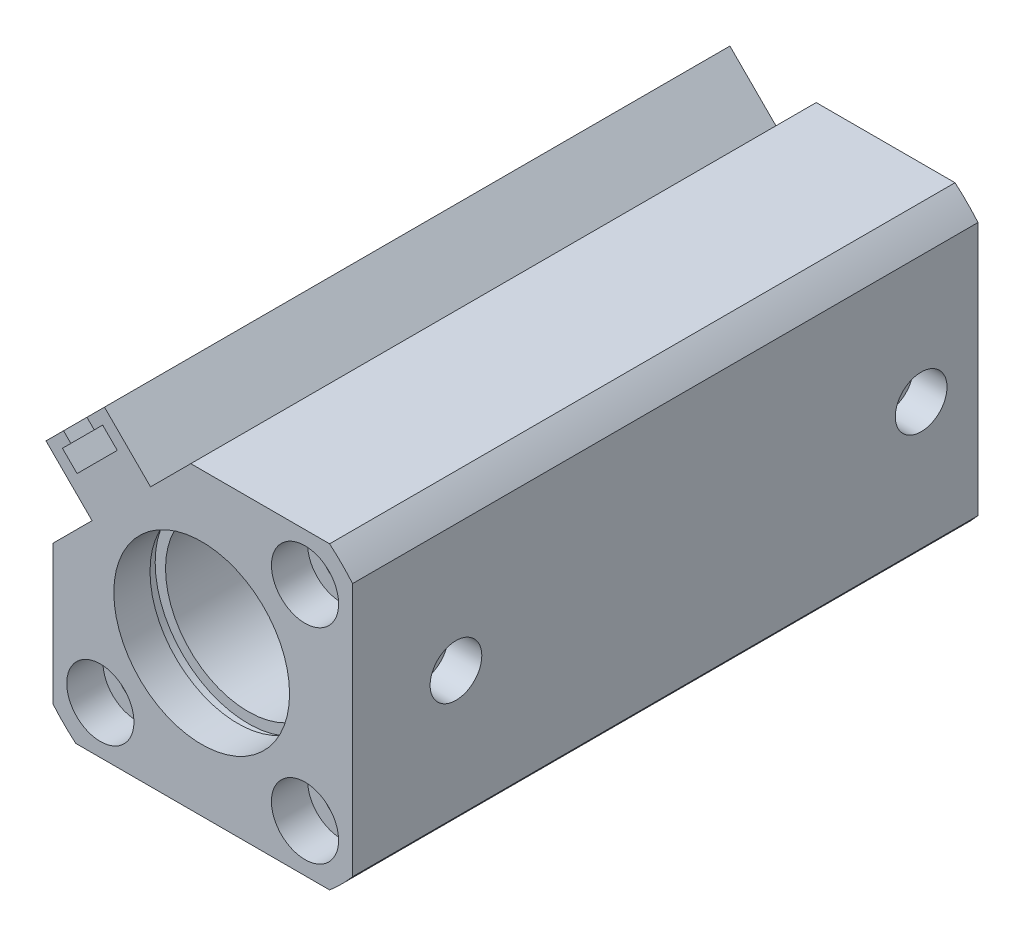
ISO-10303-21;
HEADER;
FILE_DESCRIPTION(('STEP AP214'),'2;1');
FILE_NAME('part.step','',(''),(''),'','','');
FILE_SCHEMA(('AUTOMOTIVE_DESIGN { 1 0 10303 214 1 1 1 1 }'));
ENDSEC;
DATA;
#1=APPLICATION_CONTEXT('core data for automotive mechanical design processes');
#2=APPLICATION_PROTOCOL_DEFINITION('international standard','automotive_design',2000,#1);
#3=PRODUCT_CONTEXT('',#1,'mechanical');
#4=PRODUCT('Part','Part','',(#3));
#5=PRODUCT_RELATED_PRODUCT_CATEGORY('part','',(#4));
#6=PRODUCT_DEFINITION_FORMATION('','',#4);
#7=PRODUCT_DEFINITION_CONTEXT('part definition',#1,'design');
#8=PRODUCT_DEFINITION('design','',#6,#7);
#9=PRODUCT_DEFINITION_SHAPE('','',#8);
#10=(LENGTH_UNIT() NAMED_UNIT(*) SI_UNIT(.MILLI.,.METRE.));
#11=(NAMED_UNIT(*) PLANE_ANGLE_UNIT() SI_UNIT($,.RADIAN.));
#12=(NAMED_UNIT(*) SI_UNIT($,.STERADIAN.) SOLID_ANGLE_UNIT());
#13=UNCERTAINTY_MEASURE_WITH_UNIT(LENGTH_MEASURE(1.E-05),#10,'distance_accuracy_value','');
#14=(GEOMETRIC_REPRESENTATION_CONTEXT(3) GLOBAL_UNCERTAINTY_ASSIGNED_CONTEXT((#13)) GLOBAL_UNIT_ASSIGNED_CONTEXT((#10,
#11,#12)) REPRESENTATION_CONTEXT('',''));
#15=CARTESIAN_POINT('',(0.,0.,0.));
#16=DIRECTION('',(0.,0.,1.));
#17=DIRECTION('',(1.,0.,0.));
#18=AXIS2_PLACEMENT_3D('',#15,#16,#17);
#19=CARTESIAN_POINT('',(-9.80466763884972,-9.9,27.75));
#20=DIRECTION('',(0.,0.,-1.));
#21=DIRECTION('',(-1.,0.,0.));
#22=AXIS2_PLACEMENT_3D('',#19,#20,#21);
#23=CYLINDRICAL_SURFACE('',#22,1.75);
#24=CARTESIAN_POINT('',(-9.80466763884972,-9.9,24.2499999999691));
#25=DIRECTION('',(0.,0.,1.));
#26=DIRECTION('',(1.,0.,0.));
#27=AXIS2_PLACEMENT_3D('',#24,#25,#26);
#28=CIRCLE('',#27,1.75);
#29=CARTESIAN_POINT('',(-8.05466763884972,-9.9,24.2499999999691));
#30=VERTEX_POINT('',#29);
#31=EDGE_CURVE('E176',#30,#30,#28,.T.);
#32=ORIENTED_EDGE('',*,*,#31,.T.);
#33=EDGE_LOOP('',(#32));
#34=FACE_BOUND('',#33,.T.);
#35=CARTESIAN_POINT('',(-9.80466763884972,-9.9,-24.25));
#36=DIRECTION('',(0.,0.,-1.));
#37=DIRECTION('',(-1.,0.,0.));
#38=AXIS2_PLACEMENT_3D('',#35,#36,#37);
#39=CIRCLE('',#38,1.75);
#40=CARTESIAN_POINT('',(-11.5546676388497,-9.9,-24.25));
#41=VERTEX_POINT('',#40);
#42=EDGE_CURVE('E30',#41,#41,#39,.T.);
#43=ORIENTED_EDGE('',*,*,#42,.T.);
#44=EDGE_LOOP('',(#43));
#45=FACE_BOUND('',#44,.T.);
#46=ADVANCED_FACE('F26',(#34,#45),#23,.F.);
#47=CARTESIAN_POINT('',(9.99533236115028,9.9,27.75));
#48=DIRECTION('',(0.,0.,-1.));
#49=DIRECTION('',(-1.,0.,0.));
#50=AXIS2_PLACEMENT_3D('',#47,#48,#49);
#51=CYLINDRICAL_SURFACE('',#50,1.75);
#52=CARTESIAN_POINT('',(9.99533236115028,9.9,24.2499999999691));
#53=DIRECTION('',(0.,0.,1.));
#54=DIRECTION('',(1.,0.,0.));
#55=AXIS2_PLACEMENT_3D('',#52,#53,#54);
#56=CIRCLE('',#55,1.75);
#57=CARTESIAN_POINT('',(11.7453323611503,9.9,24.2499999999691));
#58=VERTEX_POINT('',#57);
#59=EDGE_CURVE('E253',#58,#58,#56,.T.);
#60=ORIENTED_EDGE('',*,*,#59,.T.);
#61=EDGE_LOOP('',(#60));
#62=FACE_BOUND('',#61,.T.);
#63=CARTESIAN_POINT('',(9.99533236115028,9.9,-24.25));
#64=DIRECTION('',(0.,0.,-1.));
#65=DIRECTION('',(-1.,0.,0.));
#66=AXIS2_PLACEMENT_3D('',#63,#64,#65);
#67=CIRCLE('',#66,1.75);
#68=CARTESIAN_POINT('',(8.24533236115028,9.9,-24.25));
#69=VERTEX_POINT('',#68);
#70=EDGE_CURVE('E262',#69,#69,#67,.T.);
#71=ORIENTED_EDGE('',*,*,#70,.T.);
#72=EDGE_LOOP('',(#71));
#73=FACE_BOUND('',#72,.T.);
#74=ADVANCED_FACE('F306',(#62,#73),#51,.F.);
#75=CARTESIAN_POINT('',(-1.01925385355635,14.5370953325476,126.050871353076));
#76=DIRECTION('',(0.707106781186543,-0.707106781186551,0.));
#77=DIRECTION('',(0.707106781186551,0.707106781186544,0.));
#78=AXIS2_PLACEMENT_3D('',#75,#76,#77);
#79=PLANE('',#78);
#80=DIRECTION('',(0.,0.,-1.));
#81=VECTOR('',#80,1.);
#82=CARTESIAN_POINT('',(-4.94974746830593,10.6066017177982,27.75));
#83=LINE('',#82,#81);
#84=CARTESIAN_POINT('',(-4.94974746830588,10.6066017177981,27.75));
#85=VERTEX_POINT('',#84);
#86=CARTESIAN_POINT('',(-4.94974746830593,10.6066017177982,-32.75));
#87=VERTEX_POINT('',#86);
#88=EDGE_CURVE('E50',#85,#87,#83,.T.);
#89=ORIENTED_EDGE('',*,*,#88,.F.);
#90=DIRECTION('',(0.707106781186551,0.707106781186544,0.));
#91=VECTOR('',#90,1.);
#92=CARTESIAN_POINT('',(-7.73050841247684,7.8258407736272,27.75));
#93=LINE('',#92,#91);
#94=CARTESIAN_POINT('',(-1.05634918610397,14.5,27.75));
#95=VERTEX_POINT('',#94);
#96=EDGE_CURVE('E438',#85,#95,#93,.T.);
#97=ORIENTED_EDGE('',*,*,#96,.T.);
#98=DIRECTION('',(0.,0.,1.));
#99=VECTOR('',#98,1.);
#100=CARTESIAN_POINT('',(-1.05634918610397,14.5,27.75));
#101=LINE('',#100,#99);
#102=CARTESIAN_POINT('',(-1.05634918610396,14.5,-32.75));
#103=VERTEX_POINT('',#102);
#104=EDGE_CURVE('E439',#103,#95,#101,.T.);
#105=ORIENTED_EDGE('',*,*,#104,.F.);
#106=DIRECTION('',(0.707106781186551,0.707106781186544,0.));
#107=VECTOR('',#106,1.);
#108=CARTESIAN_POINT('',(-7.73050841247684,7.8258407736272,-32.75));
#109=LINE('',#108,#107);
#110=EDGE_CURVE('E35',#87,#103,#109,.T.);
#111=ORIENTED_EDGE('',*,*,#110,.F.);
#112=EDGE_LOOP('',(#89,#97,#105,#111));
#113=FACE_BOUND('',#112,.T.);
#114=ADVANCED_FACE('F313',(#113),#79,.F.);
#115=CARTESIAN_POINT('',(0.0953323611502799,0.,27.75));
#116=DIRECTION('',(0.,0.,1.));
#117=DIRECTION('',(1.,0.,0.));
#118=AXIS2_PLACEMENT_3D('',#115,#116,#117);
#119=PLANE('',#118);
#120=CARTESIAN_POINT('',(9.99533236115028,9.9,27.7499999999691));
#121=DIRECTION('',(0.,0.,1.));
#122=DIRECTION('',(1.,0.,0.));
#123=AXIS2_PLACEMENT_3D('',#120,#121,#122);
#124=CIRCLE('',#123,3.25);
#125=CARTESIAN_POINT('',(13.2453323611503,9.9,27.7499999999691));
#126=VERTEX_POINT('',#125);
#127=EDGE_CURVE('E260',#126,#126,#124,.T.);
#128=ORIENTED_EDGE('',*,*,#127,.F.);
#129=EDGE_LOOP('',(#128));
#130=FACE_BOUND('',#129,.T.);
#131=CARTESIAN_POINT('',(9.99533236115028,-9.9,27.7499999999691));
#132=DIRECTION('',(0.,0.,1.));
#133=DIRECTION('',(-1.,0.,0.));
#134=AXIS2_PLACEMENT_3D('',#131,#132,#133);
#135=CIRCLE('',#134,3.25);
#136=CARTESIAN_POINT('',(6.74533236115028,-9.9,27.7499999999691));
#137=VERTEX_POINT('',#136);
#138=EDGE_CURVE('E256',#137,#137,#135,.T.);
#139=ORIENTED_EDGE('',*,*,#138,.F.);
#140=EDGE_LOOP('',(#139));
#141=FACE_BOUND('',#140,.T.);
#142=CARTESIAN_POINT('',(-9.80466763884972,-9.9,27.7499999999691));
#143=DIRECTION('',(0.,0.,1.));
#144=DIRECTION('',(1.,0.,0.));
#145=AXIS2_PLACEMENT_3D('',#142,#143,#144);
#146=CIRCLE('',#145,3.25);
#147=CARTESIAN_POINT('',(-6.55466763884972,-9.9,27.7499999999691));
#148=VERTEX_POINT('',#147);
#149=EDGE_CURVE('E251',#148,#148,#146,.T.);
#150=ORIENTED_EDGE('',*,*,#149,.F.);
#151=EDGE_LOOP('',(#150));
#152=FACE_BOUND('',#151,.T.);
#153=CARTESIAN_POINT('',(-14.4046676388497,1.1516815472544,27.75));
#154=VERTEX_POINT('',#153);
#155=CARTESIAN_POINT('',(-10.6066017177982,4.94974746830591,27.75));
#156=VERTEX_POINT('',#155);
#157=EDGE_CURVE('E432',#154,#156,#93,.T.);
#158=ORIENTED_EDGE('',*,*,#157,.F.);
#159=DIRECTION('',(0.,-1.,0.));
#160=VECTOR('',#159,1.);
#161=CARTESIAN_POINT('',(-14.4046676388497,12.2780291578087,27.75));
#162=LINE('',#161,#160);
#163=CARTESIAN_POINT('',(-14.4046676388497,-12.2780291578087,27.75));
#164=VERTEX_POINT('',#163);
#165=EDGE_CURVE('E415',#154,#164,#162,.T.);
#166=ORIENTED_EDGE('',*,*,#165,.T.);
#167=CARTESIAN_POINT('',(0.0953323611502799,0.,27.75));
#168=DIRECTION('',(0.,0.,1.));
#169=DIRECTION('',(1.,0.,0.));
#170=AXIS2_PLACEMENT_3D('',#167,#168,#169);
#171=CIRCLE('',#170,19.);
#172=CARTESIAN_POINT('',(-12.1826967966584,-14.5,27.75));
#173=VERTEX_POINT('',#172);
#174=EDGE_CURVE('E417',#164,#173,#171,.T.);
#175=ORIENTED_EDGE('',*,*,#174,.T.);
#176=DIRECTION('',(1.,0.,0.));
#177=VECTOR('',#176,1.);
#178=CARTESIAN_POINT('',(-12.1826967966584,-14.5,27.75));
#179=LINE('',#178,#177);
#180=CARTESIAN_POINT('',(12.373361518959,-14.5,27.75));
#181=VERTEX_POINT('',#180);
#182=EDGE_CURVE('E419',#173,#181,#179,.T.);
#183=ORIENTED_EDGE('',*,*,#182,.T.);
#184=CARTESIAN_POINT('',(0.0953323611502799,0.,27.75));
#185=DIRECTION('',(0.,0.,1.));
#186=DIRECTION('',(1.,0.,0.));
#187=AXIS2_PLACEMENT_3D('',#184,#185,#186);
#188=CIRCLE('',#187,19.);
#189=CARTESIAN_POINT('',(14.5953323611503,-12.2780291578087,27.75));
#190=VERTEX_POINT('',#189);
#191=EDGE_CURVE('E407',#181,#190,#188,.T.);
#192=ORIENTED_EDGE('',*,*,#191,.T.);
#193=DIRECTION('',(0.,1.,0.));
#194=VECTOR('',#193,1.);
#195=CARTESIAN_POINT('',(14.5953323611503,12.2780291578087,27.75));
#196=LINE('',#195,#194);
#197=CARTESIAN_POINT('',(14.5953323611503,12.2780291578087,27.75));
#198=VERTEX_POINT('',#197);
#199=EDGE_CURVE('E370',#190,#198,#196,.T.);
#200=ORIENTED_EDGE('',*,*,#199,.T.);
#201=CARTESIAN_POINT('',(0.0953323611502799,0.,27.75));
#202=DIRECTION('',(0.,0.,1.));
#203=DIRECTION('',(1.,0.,0.));
#204=AXIS2_PLACEMENT_3D('',#201,#202,#203);
#205=CIRCLE('',#204,19.);
#206=CARTESIAN_POINT('',(12.3733615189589,14.5,27.75));
#207=VERTEX_POINT('',#206);
#208=EDGE_CURVE('E410',#198,#207,#205,.T.);
#209=ORIENTED_EDGE('',*,*,#208,.T.);
#210=DIRECTION('',(-1.,0.,0.));
#211=VECTOR('',#210,1.);
#212=CARTESIAN_POINT('',(-12.1826967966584,14.5,27.75));
#213=LINE('',#212,#211);
#214=EDGE_CURVE('E412',#207,#95,#213,.T.);
#215=ORIENTED_EDGE('',*,*,#214,.T.);
#216=ORIENTED_EDGE('',*,*,#96,.F.);
#217=DIRECTION('',(-0.707106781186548,0.707106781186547,0.));
#218=VECTOR('',#217,1.);
#219=CARTESIAN_POINT('',(-4.94974746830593,10.6066017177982,27.75));
#220=LINE('',#219,#218);
#221=CARTESIAN_POINT('',(-9.40452018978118,15.0613744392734,27.75));
#222=VERTEX_POINT('',#221);
#223=EDGE_CURVE('E218',#85,#222,#220,.T.);
#224=ORIENTED_EDGE('',*,*,#223,.T.);
#225=DIRECTION('',(-0.707106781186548,-0.707106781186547,0.));
#226=VECTOR('',#225,1.);
#227=CARTESIAN_POINT('',(-11.1015764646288,13.3643181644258,27.75));
#228=LINE('',#227,#226);
#229=CARTESIAN_POINT('',(-11.1015764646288,13.3643181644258,27.75));
#230=VERTEX_POINT('',#229);
#231=EDGE_CURVE('E215',#222,#230,#228,.T.);
#232=ORIENTED_EDGE('',*,*,#231,.T.);
#233=DIRECTION('',(0.707106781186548,-0.707106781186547,0.));
#234=VECTOR('',#233,1.);
#235=CARTESIAN_POINT('',(-10.3944696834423,12.6572113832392,27.75));
#236=LINE('',#235,#234);
#237=CARTESIAN_POINT('',(-10.3944696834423,12.6572113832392,27.75));
#238=VERTEX_POINT('',#237);
#239=EDGE_CURVE('E217',#230,#238,#236,.T.);
#240=ORIENTED_EDGE('',*,*,#239,.T.);
#241=DIRECTION('',(0.707106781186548,0.707106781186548,0.));
#242=VECTOR('',#241,1.);
#243=CARTESIAN_POINT('',(-10.3944696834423,12.6572113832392,27.75));
#244=LINE('',#243,#242);
#245=CARTESIAN_POINT('',(-9.58129688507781,13.4703841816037,27.75));
#246=VERTEX_POINT('',#245);
#247=EDGE_CURVE('E220',#238,#246,#244,.T.);
#248=ORIENTED_EDGE('',*,*,#247,.T.);
#249=DIRECTION('',(0.707106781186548,-0.707106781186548,0.));
#250=VECTOR('',#249,1.);
#251=CARTESIAN_POINT('',(-8.16708332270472,12.0561706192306,27.75));
#252=LINE('',#251,#250);
#253=CARTESIAN_POINT('',(-8.16708332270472,12.0561706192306,27.75));
#254=VERTEX_POINT('',#253);
#255=EDGE_CURVE('E222',#246,#254,#252,.T.);
#256=ORIENTED_EDGE('',*,*,#255,.T.);
#257=DIRECTION('',(-0.707106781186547,-0.707106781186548,0.));
#258=VECTOR('',#257,1.);
#259=CARTESIAN_POINT('',(-12.0561706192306,8.16708332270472,27.75));
#260=LINE('',#259,#258);
#261=CARTESIAN_POINT('',(-12.0561706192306,8.16708332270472,27.75));
#262=VERTEX_POINT('',#261);
#263=EDGE_CURVE('E224',#254,#262,#260,.T.);
#264=ORIENTED_EDGE('',*,*,#263,.T.);
#265=DIRECTION('',(-0.707106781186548,0.707106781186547,0.));
#266=VECTOR('',#265,1.);
#267=CARTESIAN_POINT('',(-12.0561706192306,8.16708332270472,27.75));
#268=LINE('',#267,#266);
#269=CARTESIAN_POINT('',(-13.4703841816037,9.58129688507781,27.75));
#270=VERTEX_POINT('',#269);
#271=EDGE_CURVE('E226',#262,#270,#268,.T.);
#272=ORIENTED_EDGE('',*,*,#271,.T.);
#273=DIRECTION('',(0.707106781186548,0.707106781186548,0.));
#274=VECTOR('',#273,1.);
#275=CARTESIAN_POINT('',(-13.4703841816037,9.58129688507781,27.75));
#276=LINE('',#275,#274);
#277=CARTESIAN_POINT('',(-12.6572113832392,10.3944696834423,27.75));
#278=VERTEX_POINT('',#277);
#279=EDGE_CURVE('E228',#270,#278,#276,.T.);
#280=ORIENTED_EDGE('',*,*,#279,.T.);
#281=DIRECTION('',(-0.707106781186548,0.707106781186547,0.));
#282=VECTOR('',#281,1.);
#283=CARTESIAN_POINT('',(-12.6572113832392,10.3944696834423,27.75));
#284=LINE('',#283,#282);
#285=CARTESIAN_POINT('',(-13.3643181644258,11.1015764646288,27.75));
#286=VERTEX_POINT('',#285);
#287=EDGE_CURVE('E230',#278,#286,#284,.T.);
#288=ORIENTED_EDGE('',*,*,#287,.T.);
#289=DIRECTION('',(-0.707106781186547,-0.707106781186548,0.));
#290=VECTOR('',#289,1.);
#291=CARTESIAN_POINT('',(-15.0613744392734,9.40452018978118,27.75));
#292=LINE('',#291,#290);
#293=CARTESIAN_POINT('',(-15.0613744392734,9.40452018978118,27.75));
#294=VERTEX_POINT('',#293);
#295=EDGE_CURVE('E232',#286,#294,#292,.T.);
#296=ORIENTED_EDGE('',*,*,#295,.T.);
#297=DIRECTION('',(0.707106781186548,-0.707106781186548,0.));
#298=VECTOR('',#297,1.);
#299=CARTESIAN_POINT('',(-10.6066017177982,4.94974746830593,27.75));
#300=LINE('',#299,#298);
#301=EDGE_CURVE('E234',#294,#156,#300,.T.);
#302=ORIENTED_EDGE('',*,*,#301,.T.);
#303=EDGE_LOOP('',(#158,#166,#175,#183,#192,#200,#209,#215,#216,#224,#232,#240,#248,#256,#264,
#272,#280,#288,#296,#302));
#304=FACE_BOUND('',#303,.T.);
#305=CARTESIAN_POINT('',(0.,0.,27.7499999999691));
#306=DIRECTION('',(0.,0.,1.));
#307=DIRECTION('',(1.,0.,0.));
#308=AXIS2_PLACEMENT_3D('',#305,#306,#307);
#309=CIRCLE('',#308,8.5);
#310=CARTESIAN_POINT('',(8.5,0.,27.7499999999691));
#311=VERTEX_POINT('',#310);
#312=EDGE_CURVE('E392',#311,#311,#309,.T.);
#313=ORIENTED_EDGE('',*,*,#312,.F.);
#314=EDGE_LOOP('',(#313));
#315=FACE_BOUND('',#314,.T.);
#316=ADVANCED_FACE('F325',(#130,#141,#152,#304,#315),#119,.T.);
#317=CARTESIAN_POINT('',(0.0953323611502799,0.,27.75));
#318=DIRECTION('',(0.,0.,-1.));
#319=DIRECTION('',(-1.,0.,0.));
#320=AXIS2_PLACEMENT_3D('',#317,#318,#319);
#321=CYLINDRICAL_SURFACE('',#320,19.);
#322=DIRECTION('',(0.,0.,-1.));
#323=VECTOR('',#322,1.);
#324=CARTESIAN_POINT('',(12.373361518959,-14.5,27.75));
#325=LINE('',#324,#323);
#326=CARTESIAN_POINT('',(12.373361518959,-14.5,-32.75));
#327=VERTEX_POINT('',#326);
#328=EDGE_CURVE('E388',#181,#327,#325,.T.);
#329=ORIENTED_EDGE('',*,*,#328,.T.);
#330=CARTESIAN_POINT('',(0.0953323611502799,0.,-32.75));
#331=DIRECTION('',(0.,0.,1.));
#332=DIRECTION('',(1.,0.,0.));
#333=AXIS2_PLACEMENT_3D('',#330,#331,#332);
#334=CIRCLE('',#333,19.);
#335=CARTESIAN_POINT('',(14.5953323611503,-12.2780291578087,-32.75));
#336=VERTEX_POINT('',#335);
#337=EDGE_CURVE('E381',#327,#336,#334,.T.);
#338=ORIENTED_EDGE('',*,*,#337,.T.);
#339=DIRECTION('',(0.,0.,-1.));
#340=VECTOR('',#339,1.);
#341=CARTESIAN_POINT('',(14.5953323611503,-12.2780291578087,27.75));
#342=LINE('',#341,#340);
#343=EDGE_CURVE('E366',#190,#336,#342,.T.);
#344=ORIENTED_EDGE('',*,*,#343,.F.);
#345=ORIENTED_EDGE('',*,*,#191,.F.);
#346=EDGE_LOOP('',(#329,#338,#344,#345));
#347=FACE_BOUND('',#346,.T.);
#348=ADVANCED_FACE('F28',(#347),#321,.T.);
#349=CARTESIAN_POINT('',(14.5953323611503,12.2780291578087,27.75));
#350=DIRECTION('',(-1.,0.,0.));
#351=DIRECTION('',(0.,0.,1.));
#352=AXIS2_PLACEMENT_3D('',#349,#350,#351);
#353=PLANE('',#352);
#354=CARTESIAN_POINT('',(14.5953323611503,0.,17.75));
#355=DIRECTION('',(1.,0.,0.));
#356=DIRECTION('',(0.,0.,-1.));
#357=AXIS2_PLACEMENT_3D('',#354,#355,#356);
#358=CIRCLE('',#357,2.5);
#359=CARTESIAN_POINT('',(14.5953323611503,0.,15.25));
#360=VERTEX_POINT('',#359);
#361=EDGE_CURVE('E359',#360,#360,#358,.T.);
#362=ORIENTED_EDGE('',*,*,#361,.F.);
#363=EDGE_LOOP('',(#362));
#364=FACE_BOUND('',#363,.T.);
#365=CARTESIAN_POINT('',(14.5953323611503,0.,-27.25));
#366=DIRECTION('',(1.,0.,0.));
#367=DIRECTION('',(0.,0.,-1.));
#368=AXIS2_PLACEMENT_3D('',#365,#366,#367);
#369=CIRCLE('',#368,2.5);
#370=CARTESIAN_POINT('',(14.5953323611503,0.,-29.75));
#371=VERTEX_POINT('',#370);
#372=EDGE_CURVE('E363',#371,#371,#369,.T.);
#373=ORIENTED_EDGE('',*,*,#372,.F.);
#374=EDGE_LOOP('',(#373));
#375=FACE_BOUND('',#374,.T.);
#376=ORIENTED_EDGE('',*,*,#343,.T.);
#377=DIRECTION('',(0.,1.,0.));
#378=VECTOR('',#377,1.);
#379=CARTESIAN_POINT('',(14.5953323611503,12.2780291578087,-32.75));
#380=LINE('',#379,#378);
#381=CARTESIAN_POINT('',(14.5953323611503,12.2780291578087,-32.75));
#382=VERTEX_POINT('',#381);
#383=EDGE_CURVE('E369',#336,#382,#380,.T.);
#384=ORIENTED_EDGE('',*,*,#383,.T.);
#385=DIRECTION('',(0.,0.,-1.));
#386=VECTOR('',#385,1.);
#387=CARTESIAN_POINT('',(14.5953323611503,12.2780291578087,27.75));
#388=LINE('',#387,#386);
#389=EDGE_CURVE('E374',#198,#382,#388,.T.);
#390=ORIENTED_EDGE('',*,*,#389,.F.);
#391=ORIENTED_EDGE('',*,*,#199,.F.);
#392=EDGE_LOOP('',(#376,#384,#390,#391));
#393=FACE_BOUND('',#392,.T.);
#394=ADVANCED_FACE('F346',(#364,#375,#393),#353,.F.);
#395=CARTESIAN_POINT('',(0.0953323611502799,0.,27.75));
#396=DIRECTION('',(0.,0.,-1.));
#397=DIRECTION('',(-1.,0.,0.));
#398=AXIS2_PLACEMENT_3D('',#395,#396,#397);
#399=CYLINDRICAL_SURFACE('',#398,19.);
#400=ORIENTED_EDGE('',*,*,#389,.T.);
#401=CARTESIAN_POINT('',(0.0953323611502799,0.,-32.75));
#402=DIRECTION('',(0.,0.,1.));
#403=DIRECTION('',(1.,0.,0.));
#404=AXIS2_PLACEMENT_3D('',#401,#402,#403);
#405=CIRCLE('',#404,19.);
#406=CARTESIAN_POINT('',(12.3733615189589,14.5,-32.75));
#407=VERTEX_POINT('',#406);
#408=EDGE_CURVE('E385',#382,#407,#405,.T.);
#409=ORIENTED_EDGE('',*,*,#408,.T.);
#410=DIRECTION('',(0.,0.,-1.));
#411=VECTOR('',#410,1.);
#412=CARTESIAN_POINT('',(12.3733615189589,14.5,27.75));
#413=LINE('',#412,#411);
#414=EDGE_CURVE('E427',#207,#407,#413,.T.);
#415=ORIENTED_EDGE('',*,*,#414,.F.);
#416=ORIENTED_EDGE('',*,*,#208,.F.);
#417=EDGE_LOOP('',(#400,#409,#415,#416));
#418=FACE_BOUND('',#417,.T.);
#419=ADVANCED_FACE('F343',(#418),#399,.T.);
#420=CARTESIAN_POINT('',(-12.1826967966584,14.5,27.75));
#421=DIRECTION('',(0.,-1.,0.));
#422=DIRECTION('',(0.,0.,-1.));
#423=AXIS2_PLACEMENT_3D('',#420,#421,#422);
#424=PLANE('',#423);
#425=DIRECTION('',(-1.,0.,0.));
#426=VECTOR('',#425,1.);
#427=CARTESIAN_POINT('',(-12.1826967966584,14.5,-32.75));
#428=LINE('',#427,#426);
#429=EDGE_CURVE('E397',#407,#103,#428,.T.);
#430=ORIENTED_EDGE('',*,*,#429,.T.);
#431=ORIENTED_EDGE('',*,*,#104,.T.);
#432=ORIENTED_EDGE('',*,*,#214,.F.);
#433=ORIENTED_EDGE('',*,*,#414,.T.);
#434=EDGE_LOOP('',(#430,#431,#432,#433));
#435=FACE_BOUND('',#434,.T.);
#436=ADVANCED_FACE('F339',(#435),#424,.F.);
#437=CARTESIAN_POINT('',(-14.4046676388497,12.2780291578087,27.75));
#438=DIRECTION('',(1.,0.,0.));
#439=DIRECTION('',(0.,0.,-1.));
#440=AXIS2_PLACEMENT_3D('',#437,#438,#439);
#441=PLANE('',#440);
#442=ORIENTED_EDGE('',*,*,#165,.F.);
#443=DIRECTION('',(0.,0.,-1.));
#444=VECTOR('',#443,1.);
#445=CARTESIAN_POINT('',(-14.4046676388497,1.1516815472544,27.75));
#446=LINE('',#445,#444);
#447=CARTESIAN_POINT('',(-14.4046676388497,1.1516815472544,-32.75));
#448=VERTEX_POINT('',#447);
#449=EDGE_CURVE('E576',#154,#448,#446,.T.);
#450=ORIENTED_EDGE('',*,*,#449,.T.);
#451=DIRECTION('',(0.,-1.,0.));
#452=VECTOR('',#451,1.);
#453=CARTESIAN_POINT('',(-14.4046676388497,12.2780291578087,-32.75));
#454=LINE('',#453,#452);
#455=CARTESIAN_POINT('',(-14.4046676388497,-12.2780291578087,-32.75));
#456=VERTEX_POINT('',#455);
#457=EDGE_CURVE('E400',#448,#456,#454,.T.);
#458=ORIENTED_EDGE('',*,*,#457,.T.);
#459=DIRECTION('',(0.,0.,-1.));
#460=VECTOR('',#459,1.);
#461=CARTESIAN_POINT('',(-14.4046676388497,-12.2780291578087,27.75));
#462=LINE('',#461,#460);
#463=EDGE_CURVE('E424',#164,#456,#462,.T.);
#464=ORIENTED_EDGE('',*,*,#463,.F.);
#465=EDGE_LOOP('',(#442,#450,#458,#464));
#466=FACE_BOUND('',#465,.T.);
#467=ADVANCED_FACE('F335',(#466),#441,.F.);
#468=CARTESIAN_POINT('',(0.0953323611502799,0.,27.75));
#469=DIRECTION('',(0.,0.,-1.));
#470=DIRECTION('',(-1.,0.,0.));
#471=AXIS2_PLACEMENT_3D('',#468,#469,#470);
#472=CYLINDRICAL_SURFACE('',#471,19.);
#473=ORIENTED_EDGE('',*,*,#463,.T.);
#474=CARTESIAN_POINT('',(0.0953323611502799,0.,-32.75));
#475=DIRECTION('',(0.,0.,1.));
#476=DIRECTION('',(1.,0.,0.));
#477=AXIS2_PLACEMENT_3D('',#474,#475,#476);
#478=CIRCLE('',#477,19.);
#479=CARTESIAN_POINT('',(-12.1826967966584,-14.5,-32.75));
#480=VERTEX_POINT('',#479);
#481=EDGE_CURVE('E402',#456,#480,#478,.T.);
#482=ORIENTED_EDGE('',*,*,#481,.T.);
#483=DIRECTION('',(0.,0.,-1.));
#484=VECTOR('',#483,1.);
#485=CARTESIAN_POINT('',(-12.1826967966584,-14.5,27.75));
#486=LINE('',#485,#484);
#487=EDGE_CURVE('E422',#173,#480,#486,.T.);
#488=ORIENTED_EDGE('',*,*,#487,.F.);
#489=ORIENTED_EDGE('',*,*,#174,.F.);
#490=EDGE_LOOP('',(#473,#482,#488,#489));
#491=FACE_BOUND('',#490,.T.);
#492=ADVANCED_FACE('F331',(#491),#472,.T.);
#493=CARTESIAN_POINT('',(-12.1826967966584,-14.5,27.75));
#494=DIRECTION('',(0.,1.,0.));
#495=DIRECTION('',(0.,0.,1.));
#496=AXIS2_PLACEMENT_3D('',#493,#494,#495);
#497=PLANE('',#496);
#498=ORIENTED_EDGE('',*,*,#487,.T.);
#499=DIRECTION('',(1.,0.,0.));
#500=VECTOR('',#499,1.);
#501=CARTESIAN_POINT('',(-12.1826967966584,-14.5,-32.75));
#502=LINE('',#501,#500);
#503=EDGE_CURVE('E405',#480,#327,#502,.T.);
#504=ORIENTED_EDGE('',*,*,#503,.T.);
#505=ORIENTED_EDGE('',*,*,#328,.F.);
#506=ORIENTED_EDGE('',*,*,#182,.F.);
#507=EDGE_LOOP('',(#498,#504,#505,#506));
#508=FACE_BOUND('',#507,.T.);
#509=ADVANCED_FACE('F322',(#508),#497,.F.);
#510=CARTESIAN_POINT('',(9.99533236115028,-9.9,27.75));
#511=DIRECTION('',(0.,0.,-1.));
#512=DIRECTION('',(-1.,0.,0.));
#513=AXIS2_PLACEMENT_3D('',#510,#511,#512);
#514=CYLINDRICAL_SURFACE('',#513,1.75);
#515=CARTESIAN_POINT('',(9.99533236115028,-9.9,24.2499999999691));
#516=DIRECTION('',(0.,0.,-1.));
#517=DIRECTION('',(-1.,0.,0.));
#518=AXIS2_PLACEMENT_3D('',#515,#516,#517);
#519=CIRCLE('',#518,1.75);
#520=CARTESIAN_POINT('',(8.24533236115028,-9.9,24.2499999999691));
#521=VERTEX_POINT('',#520);
#522=EDGE_CURVE('E248',#521,#521,#519,.T.);
#523=ORIENTED_EDGE('',*,*,#522,.F.);
#524=EDGE_LOOP('',(#523));
#525=FACE_BOUND('',#524,.T.);
#526=CARTESIAN_POINT('',(9.99533236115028,-9.9,-32.75));
#527=DIRECTION('',(0.,0.,1.));
#528=DIRECTION('',(-1.,0.,0.));
#529=AXIS2_PLACEMENT_3D('',#526,#527,#528);
#530=CIRCLE('',#529,1.75);
#531=CARTESIAN_POINT('',(8.24533236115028,-9.9,-32.75));
#532=VERTEX_POINT('',#531);
#533=EDGE_CURVE('E389',#532,#532,#530,.T.);
#534=ORIENTED_EDGE('',*,*,#533,.F.);
#535=EDGE_LOOP('',(#534));
#536=FACE_BOUND('',#535,.T.);
#537=ADVANCED_FACE('F321',(#525,#536),#514,.F.);
#538=CARTESIAN_POINT('',(0.0953323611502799,0.,-32.75));
#539=DIRECTION('',(0.,0.,1.));
#540=DIRECTION('',(1.,0.,0.));
#541=AXIS2_PLACEMENT_3D('',#538,#539,#540);
#542=PLANE('',#541);
#543=CARTESIAN_POINT('',(-9.80466763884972,-9.9,-32.75));
#544=DIRECTION('',(0.,0.,-1.));
#545=DIRECTION('',(-1.,0.,0.));
#546=AXIS2_PLACEMENT_3D('',#543,#544,#545);
#547=CIRCLE('',#546,3.25);
#548=CARTESIAN_POINT('',(-13.0546676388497,-9.9,-32.75));
#549=VERTEX_POINT('',#548);
#550=EDGE_CURVE('E826',#549,#549,#547,.T.);
#551=ORIENTED_EDGE('',*,*,#550,.F.);
#552=EDGE_LOOP('',(#551));
#553=FACE_BOUND('',#552,.T.);
#554=CARTESIAN_POINT('',(9.99533236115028,9.9,-32.75));
#555=DIRECTION('',(0.,0.,-1.));
#556=DIRECTION('',(-1.,0.,0.));
#557=AXIS2_PLACEMENT_3D('',#554,#555,#556);
#558=CIRCLE('',#557,3.25);
#559=CARTESIAN_POINT('',(6.74533236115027,9.9,-32.75));
#560=VERTEX_POINT('',#559);
#561=EDGE_CURVE('E271',#560,#560,#558,.T.);
#562=ORIENTED_EDGE('',*,*,#561,.F.);
#563=EDGE_LOOP('',(#562));
#564=FACE_BOUND('',#563,.T.);
#565=CARTESIAN_POINT('',(0.,0.,-32.7500000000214));
#566=DIRECTION('',(0.,0.,-1.));
#567=DIRECTION('',(-1.,0.,0.));
#568=AXIS2_PLACEMENT_3D('',#565,#566,#567);
#569=CIRCLE('',#568,9.5);
#570=CARTESIAN_POINT('',(-9.5,0.,-32.7500000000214));
#571=VERTEX_POINT('',#570);
#572=EDGE_CURVE('E264',#571,#571,#569,.T.);
#573=ORIENTED_EDGE('',*,*,#572,.F.);
#574=EDGE_LOOP('',(#573));
#575=FACE_BOUND('',#574,.T.);
#576=ORIENTED_EDGE('',*,*,#533,.T.);
#577=EDGE_LOOP('',(#576));
#578=FACE_BOUND('',#577,.T.);
#579=ORIENTED_EDGE('',*,*,#457,.F.);
#580=CARTESIAN_POINT('',(-10.6066017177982,4.94974746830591,-32.75));
#581=VERTEX_POINT('',#580);
#582=EDGE_CURVE('E11',#448,#581,#109,.T.);
#583=ORIENTED_EDGE('',*,*,#582,.T.);
#584=DIRECTION('',(0.707106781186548,-0.707106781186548,0.));
#585=VECTOR('',#584,1.);
#586=CARTESIAN_POINT('',(-10.6066017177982,4.94974746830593,-32.75));
#587=LINE('',#586,#585);
#588=CARTESIAN_POINT('',(-15.0613744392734,9.40452018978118,-32.75));
#589=VERTEX_POINT('',#588);
#590=EDGE_CURVE('E214',#589,#581,#587,.T.);
#591=ORIENTED_EDGE('',*,*,#590,.F.);
#592=DIRECTION('',(-0.707106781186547,-0.707106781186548,0.));
#593=VECTOR('',#592,1.);
#594=CARTESIAN_POINT('',(-15.0613744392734,9.40452018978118,-32.75));
#595=LINE('',#594,#593);
#596=CARTESIAN_POINT('',(-13.3643181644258,11.1015764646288,-32.75));
#597=VERTEX_POINT('',#596);
#598=EDGE_CURVE('E211',#597,#589,#595,.T.);
#599=ORIENTED_EDGE('',*,*,#598,.F.);
#600=DIRECTION('',(-0.707106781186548,0.707106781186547,0.));
#601=VECTOR('',#600,1.);
#602=CARTESIAN_POINT('',(-12.6572113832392,10.3944696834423,-32.75));
#603=LINE('',#602,#601);
#604=CARTESIAN_POINT('',(-12.6572113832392,10.3944696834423,-32.75));
#605=VERTEX_POINT('',#604);
#606=EDGE_CURVE('E208',#605,#597,#603,.T.);
#607=ORIENTED_EDGE('',*,*,#606,.F.);
#608=DIRECTION('',(0.707106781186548,0.707106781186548,0.));
#609=VECTOR('',#608,1.);
#610=CARTESIAN_POINT('',(-13.4703841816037,9.58129688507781,-32.75));
#611=LINE('',#610,#609);
#612=CARTESIAN_POINT('',(-13.4703841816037,9.58129688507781,-32.75));
#613=VERTEX_POINT('',#612);
#614=EDGE_CURVE('E205',#613,#605,#611,.T.);
#615=ORIENTED_EDGE('',*,*,#614,.F.);
#616=DIRECTION('',(-0.707106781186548,0.707106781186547,0.));
#617=VECTOR('',#616,1.);
#618=CARTESIAN_POINT('',(-12.0561706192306,8.16708332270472,-32.75));
#619=LINE('',#618,#617);
#620=CARTESIAN_POINT('',(-12.0561706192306,8.16708332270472,-32.75));
#621=VERTEX_POINT('',#620);
#622=EDGE_CURVE('E202',#621,#613,#619,.T.);
#623=ORIENTED_EDGE('',*,*,#622,.F.);
#624=DIRECTION('',(-0.707106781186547,-0.707106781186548,0.));
#625=VECTOR('',#624,1.);
#626=CARTESIAN_POINT('',(-12.0561706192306,8.16708332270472,-32.75));
#627=LINE('',#626,#625);
#628=CARTESIAN_POINT('',(-8.16708332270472,12.0561706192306,-32.75));
#629=VERTEX_POINT('',#628);
#630=EDGE_CURVE('E199',#629,#621,#627,.T.);
#631=ORIENTED_EDGE('',*,*,#630,.F.);
#632=DIRECTION('',(0.707106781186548,-0.707106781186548,0.));
#633=VECTOR('',#632,1.);
#634=CARTESIAN_POINT('',(-8.16708332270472,12.0561706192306,-32.75));
#635=LINE('',#634,#633);
#636=CARTESIAN_POINT('',(-9.58129688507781,13.4703841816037,-32.75));
#637=VERTEX_POINT('',#636);
#638=EDGE_CURVE('E196',#637,#629,#635,.T.);
#639=ORIENTED_EDGE('',*,*,#638,.F.);
#640=DIRECTION('',(0.707106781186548,0.707106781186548,0.));
#641=VECTOR('',#640,1.);
#642=CARTESIAN_POINT('',(-10.3944696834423,12.6572113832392,-32.75));
#643=LINE('',#642,#641);
#644=CARTESIAN_POINT('',(-10.3944696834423,12.6572113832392,-32.75));
#645=VERTEX_POINT('',#644);
#646=EDGE_CURVE('E193',#645,#637,#643,.T.);
#647=ORIENTED_EDGE('',*,*,#646,.F.);
#648=DIRECTION('',(0.707106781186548,-0.707106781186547,0.));
#649=VECTOR('',#648,1.);
#650=CARTESIAN_POINT('',(-10.3944696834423,12.6572113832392,-32.75));
#651=LINE('',#650,#649);
#652=CARTESIAN_POINT('',(-11.1015764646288,13.3643181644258,-32.75));
#653=VERTEX_POINT('',#652);
#654=EDGE_CURVE('E190',#653,#645,#651,.T.);
#655=ORIENTED_EDGE('',*,*,#654,.F.);
#656=DIRECTION('',(-0.707106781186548,-0.707106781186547,0.));
#657=VECTOR('',#656,1.);
#658=CARTESIAN_POINT('',(-11.1015764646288,13.3643181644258,-32.75));
#659=LINE('',#658,#657);
#660=CARTESIAN_POINT('',(-9.40452018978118,15.0613744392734,-32.75));
#661=VERTEX_POINT('',#660);
#662=EDGE_CURVE('E187',#661,#653,#659,.T.);
#663=ORIENTED_EDGE('',*,*,#662,.F.);
#664=DIRECTION('',(-0.707106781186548,0.707106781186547,0.));
#665=VECTOR('',#664,1.);
#666=CARTESIAN_POINT('',(-4.94974746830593,10.6066017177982,-32.75));
#667=LINE('',#666,#665);
#668=EDGE_CURVE('E179',#87,#661,#667,.T.);
#669=ORIENTED_EDGE('',*,*,#668,.F.);
#670=ORIENTED_EDGE('',*,*,#110,.T.);
#671=ORIENTED_EDGE('',*,*,#429,.F.);
#672=ORIENTED_EDGE('',*,*,#408,.F.);
#673=ORIENTED_EDGE('',*,*,#383,.F.);
#674=ORIENTED_EDGE('',*,*,#337,.F.);
#675=ORIENTED_EDGE('',*,*,#503,.F.);
#676=ORIENTED_EDGE('',*,*,#481,.F.);
#677=EDGE_LOOP('',(#579,#583,#591,#599,#607,#615,#623,#631,#639,#647,#655,#663,#669,#670,#671,
#672,#673,#674,#675,#676));
#678=FACE_BOUND('',#677,.T.);
#679=ADVANCED_FACE('F319',(#553,#564,#575,#578,#678),#542,.F.);
#680=CARTESIAN_POINT('',(0.,0.,24.2499999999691));
#681=DIRECTION('',(0.,0.,1.));
#682=DIRECTION('',(1.,0.,0.));
#683=AXIS2_PLACEMENT_3D('',#680,#681,#682);
#684=CYLINDRICAL_SURFACE('',#683,8.5);
#685=CARTESIAN_POINT('',(0.,0.,24.2499999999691));
#686=DIRECTION('',(0.,0.,1.));
#687=DIRECTION('',(1.,0.,0.));
#688=AXIS2_PLACEMENT_3D('',#685,#686,#687);
#689=CIRCLE('',#688,8.5);
#690=CARTESIAN_POINT('',(8.5,0.,24.2499999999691));
#691=VERTEX_POINT('',#690);
#692=EDGE_CURVE('E824',#691,#691,#689,.F.);
#693=ORIENTED_EDGE('',*,*,#692,.T.);
#694=EDGE_LOOP('',(#693));
#695=FACE_BOUND('',#694,.T.);
#696=ORIENTED_EDGE('',*,*,#312,.T.);
#697=EDGE_LOOP('',(#696));
#698=FACE_BOUND('',#697,.T.);
#699=ADVANCED_FACE('F461',(#695,#698),#684,.F.);
#700=CARTESIAN_POINT('',(11.3453323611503,0.,-27.25));
#701=DIRECTION('',(1.,0.,0.));
#702=DIRECTION('',(0.,0.,-1.));
#703=AXIS2_PLACEMENT_3D('',#700,#701,#702);
#704=CYLINDRICAL_SURFACE('',#703,2.5);
#705=CARTESIAN_POINT('',(11.3453323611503,0.,-27.25));
#706=DIRECTION('',(1.,0.,0.));
#707=DIRECTION('',(0.,0.,-1.));
#708=AXIS2_PLACEMENT_3D('',#705,#706,#707);
#709=CIRCLE('',#708,2.5);
#710=CARTESIAN_POINT('',(11.3453323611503,0.,-29.75));
#711=VERTEX_POINT('',#710);
#712=EDGE_CURVE('E450',#711,#711,#709,.T.);
#713=CARTESIAN_POINT('',(11.3453323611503,0.,-29.75));
#714=CARTESIAN_POINT('',(11.3791865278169,0.,-29.75));
#715=CARTESIAN_POINT('',(11.4130406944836,0.,-29.75));
#716=CARTESIAN_POINT('',(11.4807490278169,0.,-29.75));
#717=CARTESIAN_POINT('',(11.5146031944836,0.,-29.75));
#718=CARTESIAN_POINT('',(11.5823115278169,0.,-29.75));
#719=CARTESIAN_POINT('',(11.6161656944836,0.,-29.75));
#720=CARTESIAN_POINT('',(11.6838740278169,0.,-29.75));
#721=CARTESIAN_POINT('',(11.7177281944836,0.,-29.75));
#722=CARTESIAN_POINT('',(11.7854365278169,0.,-29.75));
#723=CARTESIAN_POINT('',(11.8192906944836,0.,-29.75));
#724=CARTESIAN_POINT('',(11.8869990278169,0.,-29.75));
#725=CARTESIAN_POINT('',(11.9208531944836,0.,-29.75));
#726=CARTESIAN_POINT('',(11.9885615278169,0.,-29.75));
#727=CARTESIAN_POINT('',(12.0224156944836,0.,-29.75));
#728=CARTESIAN_POINT('',(12.0901240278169,0.,-29.75));
#729=CARTESIAN_POINT('',(12.1239781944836,0.,-29.75));
#730=CARTESIAN_POINT('',(12.1916865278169,0.,-29.75));
#731=CARTESIAN_POINT('',(12.2255406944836,0.,-29.75));
#732=CARTESIAN_POINT('',(12.2932490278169,0.,-29.75));
#733=CARTESIAN_POINT('',(12.3271031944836,0.,-29.75));
#734=CARTESIAN_POINT('',(12.3948115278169,0.,-29.75));
#735=CARTESIAN_POINT('',(12.4286656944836,0.,-29.75));
#736=CARTESIAN_POINT('',(12.4963740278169,0.,-29.75));
#737=CARTESIAN_POINT('',(12.5302281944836,0.,-29.75));
#738=CARTESIAN_POINT('',(12.5979365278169,0.,-29.75));
#739=CARTESIAN_POINT('',(12.6317906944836,0.,-29.75));
#740=CARTESIAN_POINT('',(12.6994990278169,0.,-29.75));
#741=CARTESIAN_POINT('',(12.7333531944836,0.,-29.75));
#742=CARTESIAN_POINT('',(12.8010615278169,0.,-29.75));
#743=CARTESIAN_POINT('',(12.8349156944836,0.,-29.75));
#744=CARTESIAN_POINT('',(12.9026240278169,0.,-29.75));
#745=CARTESIAN_POINT('',(12.9364781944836,0.,-29.75));
#746=CARTESIAN_POINT('',(13.0041865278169,0.,-29.75));
#747=CARTESIAN_POINT('',(13.0380406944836,0.,-29.75));
#748=CARTESIAN_POINT('',(13.1057490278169,0.,-29.75));
#749=CARTESIAN_POINT('',(13.1396031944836,0.,-29.75));
#750=CARTESIAN_POINT('',(13.2073115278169,0.,-29.75));
#751=CARTESIAN_POINT('',(13.2411656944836,0.,-29.75));
#752=CARTESIAN_POINT('',(13.3088740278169,0.,-29.75));
#753=CARTESIAN_POINT('',(13.3427281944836,0.,-29.75));
#754=CARTESIAN_POINT('',(13.4104365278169,0.,-29.75));
#755=CARTESIAN_POINT('',(13.4442906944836,0.,-29.75));
#756=CARTESIAN_POINT('',(13.5119990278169,0.,-29.75));
#757=CARTESIAN_POINT('',(13.5458531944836,0.,-29.75));
#758=CARTESIAN_POINT('',(13.6135615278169,0.,-29.75));
#759=CARTESIAN_POINT('',(13.6474156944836,0.,-29.75));
#760=CARTESIAN_POINT('',(13.7151240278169,0.,-29.75));
#761=CARTESIAN_POINT('',(13.7489781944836,0.,-29.75));
#762=CARTESIAN_POINT('',(13.8166865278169,0.,-29.75));
#763=CARTESIAN_POINT('',(13.8505406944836,0.,-29.75));
#764=CARTESIAN_POINT('',(13.9182490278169,0.,-29.75));
#765=CARTESIAN_POINT('',(13.9521031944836,0.,-29.75));
#766=CARTESIAN_POINT('',(14.0198115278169,0.,-29.75));
#767=CARTESIAN_POINT('',(14.0536656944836,0.,-29.75));
#768=CARTESIAN_POINT('',(14.1213740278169,0.,-29.75));
#769=CARTESIAN_POINT('',(14.1552281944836,0.,-29.75));
#770=CARTESIAN_POINT('',(14.2229365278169,0.,-29.75));
#771=CARTESIAN_POINT('',(14.2567906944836,0.,-29.75));
#772=CARTESIAN_POINT('',(14.3244990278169,0.,-29.75));
#773=CARTESIAN_POINT('',(14.3583531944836,0.,-29.75));
#774=CARTESIAN_POINT('',(14.4260615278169,0.,-29.75));
#775=CARTESIAN_POINT('',(14.4599156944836,0.,-29.75));
#776=CARTESIAN_POINT('',(14.5276240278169,0.,-29.75));
#777=CARTESIAN_POINT('',(14.5614781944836,0.,-29.75));
#778=CARTESIAN_POINT('',(14.5953323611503,0.,-29.75));
#779=B_SPLINE_CURVE_WITH_KNOTS('',3,(#713,#714,#715,#716,#717,#718,#719,#720,#721,#722,#723,
#724,#725,#726,#727,#728,#729,#730,#731,#732,#733,#734,#735,#736,#737,#738,#739,#740,#741,#742,
#743,#744,#745,#746,#747,#748,#749,#750,#751,#752,#753,#754,#755,#756,#757,#758,#759,#760,#761,
#762,#763,#764,#765,#766,#767,#768,#769,#770,#771,#772,#773,#774,#775,#776,#777,#778),
.UNSPECIFIED.,.F.,.F.,(4,2,2,2,2,2,2,2,2,2,2,2,2,2,2,2,2,2,2,2,2,2,2,2,2,2,2,2,2,2,2,2,4),(0.,
0.101562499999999,0.203124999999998,0.304687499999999,0.406249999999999,0.5078125,
0.609374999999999,0.7109375,0.812499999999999,0.914062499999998,1.015625,1.1171875,1.21875,
1.3203125,1.421875,1.5234375,1.625,1.7265625,1.828125,1.9296875,2.03125,2.1328125,2.234375,
2.3359375,2.4375,2.5390625,2.640625,2.7421875,2.84375,2.9453125,3.046875,3.1484375,3.25),.UNSPECIFIED.);
#780=EDGE_CURVE('BSEAM464',#711,#371,#779,.T.);
#781=ORIENTED_EDGE('',*,*,#712,.F.);
#782=ORIENTED_EDGE('',*,*,#372,.T.);
#783=ORIENTED_EDGE('',*,*,#780,.T.);
#784=ORIENTED_EDGE('',*,*,#780,.F.);
#785=EDGE_LOOP('',(#781,#783,#782,#784));
#786=FACE_BOUND('',#785,.T.);
#787=ADVANCED_FACE('F464',(#786),#704,.F.);
#788=CARTESIAN_POINT('',(11.3453323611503,0.,-27.25));
#789=DIRECTION('',(1.,0.,0.));
#790=DIRECTION('',(0.,0.,-1.));
#791=AXIS2_PLACEMENT_3D('',#788,#789,#790);
#792=PLANE('',#791);
#793=ORIENTED_EDGE('',*,*,#712,.T.);
#794=EDGE_LOOP('',(#793));
#795=FACE_BOUND('',#794,.T.);
#796=ADVANCED_FACE('F468',(#795),#792,.T.);
#797=CARTESIAN_POINT('',(11.3453323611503,0.,17.75));
#798=DIRECTION('',(1.,0.,0.));
#799=DIRECTION('',(0.,0.,-1.));
#800=AXIS2_PLACEMENT_3D('',#797,#798,#799);
#801=CYLINDRICAL_SURFACE('',#800,2.5);
#802=CARTESIAN_POINT('',(11.3453323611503,0.,17.75));
#803=DIRECTION('',(1.,0.,0.));
#804=DIRECTION('',(0.,0.,-1.));
#805=AXIS2_PLACEMENT_3D('',#802,#803,#804);
#806=CIRCLE('',#805,2.5);
#807=CARTESIAN_POINT('',(11.3453323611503,0.,15.25));
#808=VERTEX_POINT('',#807);
#809=EDGE_CURVE('E446',#808,#808,#806,.T.);
#810=CARTESIAN_POINT('',(11.3453323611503,0.,15.25));
#811=CARTESIAN_POINT('',(11.3791865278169,0.,15.25));
#812=CARTESIAN_POINT('',(11.4130406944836,0.,15.25));
#813=CARTESIAN_POINT('',(11.4807490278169,0.,15.25));
#814=CARTESIAN_POINT('',(11.5146031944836,0.,15.25));
#815=CARTESIAN_POINT('',(11.5823115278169,0.,15.25));
#816=CARTESIAN_POINT('',(11.6161656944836,0.,15.25));
#817=CARTESIAN_POINT('',(11.6838740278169,0.,15.25));
#818=CARTESIAN_POINT('',(11.7177281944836,0.,15.25));
#819=CARTESIAN_POINT('',(11.7854365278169,0.,15.25));
#820=CARTESIAN_POINT('',(11.8192906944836,0.,15.25));
#821=CARTESIAN_POINT('',(11.8869990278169,0.,15.25));
#822=CARTESIAN_POINT('',(11.9208531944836,0.,15.25));
#823=CARTESIAN_POINT('',(11.9885615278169,0.,15.25));
#824=CARTESIAN_POINT('',(12.0224156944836,0.,15.25));
#825=CARTESIAN_POINT('',(12.0901240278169,0.,15.25));
#826=CARTESIAN_POINT('',(12.1239781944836,0.,15.25));
#827=CARTESIAN_POINT('',(12.1916865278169,0.,15.25));
#828=CARTESIAN_POINT('',(12.2255406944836,0.,15.25));
#829=CARTESIAN_POINT('',(12.2932490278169,0.,15.25));
#830=CARTESIAN_POINT('',(12.3271031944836,0.,15.25));
#831=CARTESIAN_POINT('',(12.3948115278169,0.,15.25));
#832=CARTESIAN_POINT('',(12.4286656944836,0.,15.25));
#833=CARTESIAN_POINT('',(12.4963740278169,0.,15.25));
#834=CARTESIAN_POINT('',(12.5302281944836,0.,15.25));
#835=CARTESIAN_POINT('',(12.5979365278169,0.,15.25));
#836=CARTESIAN_POINT('',(12.6317906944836,0.,15.25));
#837=CARTESIAN_POINT('',(12.6994990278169,0.,15.25));
#838=CARTESIAN_POINT('',(12.7333531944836,0.,15.25));
#839=CARTESIAN_POINT('',(12.8010615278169,0.,15.25));
#840=CARTESIAN_POINT('',(12.8349156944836,0.,15.25));
#841=CARTESIAN_POINT('',(12.9026240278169,0.,15.25));
#842=CARTESIAN_POINT('',(12.9364781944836,0.,15.25));
#843=CARTESIAN_POINT('',(13.0041865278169,0.,15.25));
#844=CARTESIAN_POINT('',(13.0380406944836,0.,15.25));
#845=CARTESIAN_POINT('',(13.1057490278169,0.,15.25));
#846=CARTESIAN_POINT('',(13.1396031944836,0.,15.25));
#847=CARTESIAN_POINT('',(13.2073115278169,0.,15.25));
#848=CARTESIAN_POINT('',(13.2411656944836,0.,15.25));
#849=CARTESIAN_POINT('',(13.3088740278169,0.,15.25));
#850=CARTESIAN_POINT('',(13.3427281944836,0.,15.25));
#851=CARTESIAN_POINT('',(13.4104365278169,0.,15.25));
#852=CARTESIAN_POINT('',(13.4442906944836,0.,15.25));
#853=CARTESIAN_POINT('',(13.5119990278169,0.,15.25));
#854=CARTESIAN_POINT('',(13.5458531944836,0.,15.25));
#855=CARTESIAN_POINT('',(13.6135615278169,0.,15.25));
#856=CARTESIAN_POINT('',(13.6474156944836,0.,15.25));
#857=CARTESIAN_POINT('',(13.7151240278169,0.,15.25));
#858=CARTESIAN_POINT('',(13.7489781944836,0.,15.25));
#859=CARTESIAN_POINT('',(13.8166865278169,0.,15.25));
#860=CARTESIAN_POINT('',(13.8505406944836,0.,15.25));
#861=CARTESIAN_POINT('',(13.9182490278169,0.,15.25));
#862=CARTESIAN_POINT('',(13.9521031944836,0.,15.25));
#863=CARTESIAN_POINT('',(14.0198115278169,0.,15.25));
#864=CARTESIAN_POINT('',(14.0536656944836,0.,15.25));
#865=CARTESIAN_POINT('',(14.1213740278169,0.,15.25));
#866=CARTESIAN_POINT('',(14.1552281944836,0.,15.25));
#867=CARTESIAN_POINT('',(14.2229365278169,0.,15.25));
#868=CARTESIAN_POINT('',(14.2567906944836,0.,15.25));
#869=CARTESIAN_POINT('',(14.3244990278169,0.,15.25));
#870=CARTESIAN_POINT('',(14.3583531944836,0.,15.25));
#871=CARTESIAN_POINT('',(14.4260615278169,0.,15.25));
#872=CARTESIAN_POINT('',(14.4599156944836,0.,15.25));
#873=CARTESIAN_POINT('',(14.5276240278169,0.,15.25));
#874=CARTESIAN_POINT('',(14.5614781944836,0.,15.25));
#875=CARTESIAN_POINT('',(14.5953323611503,0.,15.25));
#876=B_SPLINE_CURVE_WITH_KNOTS('',3,(#810,#811,#812,#813,#814,#815,#816,#817,#818,#819,#820,
#821,#822,#823,#824,#825,#826,#827,#828,#829,#830,#831,#832,#833,#834,#835,#836,#837,#838,#839,
#840,#841,#842,#843,#844,#845,#846,#847,#848,#849,#850,#851,#852,#853,#854,#855,#856,#857,#858,
#859,#860,#861,#862,#863,#864,#865,#866,#867,#868,#869,#870,#871,#872,#873,#874,#875),
.UNSPECIFIED.,.F.,.F.,(4,2,2,2,2,2,2,2,2,2,2,2,2,2,2,2,2,2,2,2,2,2,2,2,2,2,2,2,2,2,2,2,4),(0.,
0.101562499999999,0.203124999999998,0.304687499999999,0.406249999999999,0.5078125,
0.609374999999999,0.7109375,0.812499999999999,0.914062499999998,1.015625,1.1171875,1.21875,
1.3203125,1.421875,1.5234375,1.625,1.7265625,1.828125,1.9296875,2.03125,2.1328125,2.234375,
2.3359375,2.4375,2.5390625,2.640625,2.7421875,2.84375,2.9453125,3.046875,3.1484375,3.25),.UNSPECIFIED.);
#877=EDGE_CURVE('BSEAM489',#808,#360,#876,.T.);
#878=ORIENTED_EDGE('',*,*,#809,.F.);
#879=ORIENTED_EDGE('',*,*,#361,.T.);
#880=ORIENTED_EDGE('',*,*,#877,.T.);
#881=ORIENTED_EDGE('',*,*,#877,.F.);
#882=EDGE_LOOP('',(#878,#880,#879,#881));
#883=FACE_BOUND('',#882,.T.);
#884=ADVANCED_FACE('F489',(#883),#801,.F.);
#885=CARTESIAN_POINT('',(11.3453323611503,0.,17.75));
#886=DIRECTION('',(1.,0.,0.));
#887=DIRECTION('',(0.,0.,-1.));
#888=AXIS2_PLACEMENT_3D('',#885,#886,#887);
#889=PLANE('',#888);
#890=ORIENTED_EDGE('',*,*,#809,.T.);
#891=EDGE_LOOP('',(#890));
#892=FACE_BOUND('',#891,.T.);
#893=ADVANCED_FACE('F493',(#892),#889,.T.);
#894=ORIENTED_EDGE('',*,*,#157,.T.);
#895=DIRECTION('',(0.,0.,-1.));
#896=VECTOR('',#895,1.);
#897=CARTESIAN_POINT('',(-10.6066017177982,4.94974746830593,27.75));
#898=LINE('',#897,#896);
#899=EDGE_CURVE('E43',#156,#581,#898,.T.);
#900=ORIENTED_EDGE('',*,*,#899,.T.);
#901=ORIENTED_EDGE('',*,*,#582,.F.);
#902=ORIENTED_EDGE('',*,*,#449,.F.);
#903=EDGE_LOOP('',(#894,#900,#901,#902));
#904=FACE_BOUND('',#903,.T.);
#905=ADVANCED_FACE('F497',(#904),#79,.F.);
#906=CARTESIAN_POINT('',(-4.94974746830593,10.6066017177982,27.75));
#907=DIRECTION('',(-0.707106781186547,-0.707106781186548,0.));
#908=DIRECTION('',(0.707106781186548,-0.707106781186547,0.));
#909=AXIS2_PLACEMENT_3D('',#906,#907,#908);
#910=PLANE('',#909);
#911=ORIENTED_EDGE('',*,*,#88,.T.);
#912=ORIENTED_EDGE('',*,*,#668,.T.);
#913=DIRECTION('',(0.,0.,-1.));
#914=VECTOR('',#913,1.);
#915=CARTESIAN_POINT('',(-9.40452018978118,15.0613744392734,27.75));
#916=LINE('',#915,#914);
#917=EDGE_CURVE('E573',#222,#661,#916,.T.);
#918=ORIENTED_EDGE('',*,*,#917,.F.);
#919=ORIENTED_EDGE('',*,*,#223,.F.);
#920=EDGE_LOOP('',(#911,#912,#918,#919));
#921=FACE_BOUND('',#920,.T.);
#922=ADVANCED_FACE('F501',(#921),#910,.F.);
#923=CARTESIAN_POINT('',(-11.1015764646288,13.3643181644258,27.75));
#924=DIRECTION('',(0.707106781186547,-0.707106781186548,0.));
#925=DIRECTION('',(0.707106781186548,0.707106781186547,0.));
#926=AXIS2_PLACEMENT_3D('',#923,#924,#925);
#927=PLANE('',#926);
#928=ORIENTED_EDGE('',*,*,#917,.T.);
#929=ORIENTED_EDGE('',*,*,#662,.T.);
#930=DIRECTION('',(0.,0.,-1.));
#931=VECTOR('',#930,1.);
#932=CARTESIAN_POINT('',(-11.1015764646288,13.3643181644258,27.75));
#933=LINE('',#932,#931);
#934=EDGE_CURVE('E568',#230,#653,#933,.T.);
#935=ORIENTED_EDGE('',*,*,#934,.F.);
#936=ORIENTED_EDGE('',*,*,#231,.F.);
#937=EDGE_LOOP('',(#928,#929,#935,#936));
#938=FACE_BOUND('',#937,.T.);
#939=ADVANCED_FACE('F504',(#938),#927,.F.);
#940=CARTESIAN_POINT('',(-10.3944696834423,12.6572113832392,27.75));
#941=DIRECTION('',(0.707106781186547,0.707106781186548,0.));
#942=DIRECTION('',(-0.707106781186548,0.707106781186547,0.));
#943=AXIS2_PLACEMENT_3D('',#940,#941,#942);
#944=PLANE('',#943);
#945=ORIENTED_EDGE('',*,*,#934,.T.);
#946=ORIENTED_EDGE('',*,*,#654,.T.);
#947=DIRECTION('',(0.,0.,-1.));
#948=VECTOR('',#947,1.);
#949=CARTESIAN_POINT('',(-10.3944696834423,12.6572113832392,27.75));
#950=LINE('',#949,#948);
#951=EDGE_CURVE('E566',#238,#645,#950,.T.);
#952=ORIENTED_EDGE('',*,*,#951,.F.);
#953=ORIENTED_EDGE('',*,*,#239,.F.);
#954=EDGE_LOOP('',(#945,#946,#952,#953));
#955=FACE_BOUND('',#954,.T.);
#956=ADVANCED_FACE('F508',(#955),#944,.F.);
#957=CARTESIAN_POINT('',(-10.3944696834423,12.6572113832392,27.75));
#958=DIRECTION('',(-0.707106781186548,0.707106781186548,0.));
#959=DIRECTION('',(-0.707106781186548,-0.707106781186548,0.));
#960=AXIS2_PLACEMENT_3D('',#957,#958,#959);
#961=PLANE('',#960);
#962=ORIENTED_EDGE('',*,*,#951,.T.);
#963=ORIENTED_EDGE('',*,*,#646,.T.);
#964=DIRECTION('',(0.,0.,-1.));
#965=VECTOR('',#964,1.);
#966=CARTESIAN_POINT('',(-9.58129688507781,13.4703841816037,27.75));
#967=LINE('',#966,#965);
#968=EDGE_CURVE('E557',#246,#637,#967,.T.);
#969=ORIENTED_EDGE('',*,*,#968,.F.);
#970=ORIENTED_EDGE('',*,*,#247,.F.);
#971=EDGE_LOOP('',(#962,#963,#969,#970));
#972=FACE_BOUND('',#971,.T.);
#973=ADVANCED_FACE('F512',(#972),#961,.F.);
#974=CARTESIAN_POINT('',(-8.16708332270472,12.0561706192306,27.75));
#975=DIRECTION('',(0.707106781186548,0.707106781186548,0.));
#976=DIRECTION('',(-0.707106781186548,0.707106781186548,0.));
#977=AXIS2_PLACEMENT_3D('',#974,#975,#976);
#978=PLANE('',#977);
#979=ORIENTED_EDGE('',*,*,#968,.T.);
#980=ORIENTED_EDGE('',*,*,#638,.T.);
#981=DIRECTION('',(0.,0.,-1.));
#982=VECTOR('',#981,1.);
#983=CARTESIAN_POINT('',(-8.16708332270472,12.0561706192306,27.75));
#984=LINE('',#983,#982);
#985=EDGE_CURVE('E553',#254,#629,#984,.T.);
#986=ORIENTED_EDGE('',*,*,#985,.F.);
#987=ORIENTED_EDGE('',*,*,#255,.F.);
#988=EDGE_LOOP('',(#979,#980,#986,#987));
#989=FACE_BOUND('',#988,.T.);
#990=ADVANCED_FACE('F516',(#989),#978,.F.);
#991=CARTESIAN_POINT('',(-12.0561706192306,8.16708332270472,27.75));
#992=DIRECTION('',(0.707106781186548,-0.707106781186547,0.));
#993=DIRECTION('',(0.707106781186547,0.707106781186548,0.));
#994=AXIS2_PLACEMENT_3D('',#991,#992,#993);
#995=PLANE('',#994);
#996=CARTESIAN_POINT('',(-10.1116269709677,10.1116269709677,13.875));
#997=DIRECTION('',(-0.707106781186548,0.707106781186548,0.));
#998=DIRECTION('',(-0.707106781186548,-0.707106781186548,0.));
#999=AXIS2_PLACEMENT_3D('',#996,#997,#998);
#1000=CIRCLE('',#999,0.999999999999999);
#1001=CARTESIAN_POINT('',(-10.8187337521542,9.40452018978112,13.875));
#1002=VERTEX_POINT('',#1001);
#1003=EDGE_CURVE('E175',#1002,#1002,#1000,.T.);
#1004=ORIENTED_EDGE('',*,*,#1003,.F.);
#1005=EDGE_LOOP('',(#1004));
#1006=FACE_BOUND('',#1005,.T.);
#1007=ORIENTED_EDGE('',*,*,#985,.T.);
#1008=ORIENTED_EDGE('',*,*,#630,.T.);
#1009=DIRECTION('',(0.,0.,-1.));
#1010=VECTOR('',#1009,1.);
#1011=CARTESIAN_POINT('',(-12.0561706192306,8.16708332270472,27.75));
#1012=LINE('',#1011,#1010);
#1013=EDGE_CURVE('E558',#262,#621,#1012,.T.);
#1014=ORIENTED_EDGE('',*,*,#1013,.F.);
#1015=ORIENTED_EDGE('',*,*,#263,.F.);
#1016=EDGE_LOOP('',(#1007,#1008,#1014,#1015));
#1017=FACE_BOUND('',#1016,.T.);
#1018=ADVANCED_FACE('F520',(#1006,#1017),#995,.F.);
#1019=CARTESIAN_POINT('',(-12.0561706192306,8.16708332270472,27.75));
#1020=DIRECTION('',(-0.707106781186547,-0.707106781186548,0.));
#1021=DIRECTION('',(0.707106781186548,-0.707106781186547,0.));
#1022=AXIS2_PLACEMENT_3D('',#1019,#1020,#1021);
#1023=PLANE('',#1022);
#1024=ORIENTED_EDGE('',*,*,#1013,.T.);
#1025=ORIENTED_EDGE('',*,*,#622,.T.);
#1026=DIRECTION('',(0.,0.,-1.));
#1027=VECTOR('',#1026,1.);
#1028=CARTESIAN_POINT('',(-13.4703841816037,9.58129688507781,27.75));
#1029=LINE('',#1028,#1027);
#1030=EDGE_CURVE('E613',#270,#613,#1029,.T.);
#1031=ORIENTED_EDGE('',*,*,#1030,.F.);
#1032=ORIENTED_EDGE('',*,*,#271,.F.);
#1033=EDGE_LOOP('',(#1024,#1025,#1031,#1032));
#1034=FACE_BOUND('',#1033,.T.);
#1035=ADVANCED_FACE('F524',(#1034),#1023,.F.);
#1036=CARTESIAN_POINT('',(-13.4703841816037,9.58129688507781,27.75));
#1037=DIRECTION('',(-0.707106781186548,0.707106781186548,0.));
#1038=DIRECTION('',(-0.707106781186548,-0.707106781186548,0.));
#1039=AXIS2_PLACEMENT_3D('',#1036,#1037,#1038);
#1040=PLANE('',#1039);
#1041=ORIENTED_EDGE('',*,*,#1030,.T.);
#1042=ORIENTED_EDGE('',*,*,#614,.T.);
#1043=DIRECTION('',(0.,0.,-1.));
#1044=VECTOR('',#1043,1.);
#1045=CARTESIAN_POINT('',(-12.6572113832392,10.3944696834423,27.75));
#1046=LINE('',#1045,#1044);
#1047=EDGE_CURVE('E615',#278,#605,#1046,.T.);
#1048=ORIENTED_EDGE('',*,*,#1047,.F.);
#1049=ORIENTED_EDGE('',*,*,#279,.F.);
#1050=EDGE_LOOP('',(#1041,#1042,#1048,#1049));
#1051=FACE_BOUND('',#1050,.T.);
#1052=ADVANCED_FACE('F528',(#1051),#1040,.F.);
#1053=CARTESIAN_POINT('',(-12.6572113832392,10.3944696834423,27.75));
#1054=DIRECTION('',(-0.707106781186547,-0.707106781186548,0.));
#1055=DIRECTION('',(0.707106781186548,-0.707106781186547,0.));
#1056=AXIS2_PLACEMENT_3D('',#1053,#1054,#1055);
#1057=PLANE('',#1056);
#1058=ORIENTED_EDGE('',*,*,#1047,.T.);
#1059=ORIENTED_EDGE('',*,*,#606,.T.);
#1060=DIRECTION('',(0.,0.,-1.));
#1061=VECTOR('',#1060,1.);
#1062=CARTESIAN_POINT('',(-13.3643181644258,11.1015764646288,27.75));
#1063=LINE('',#1062,#1061);
#1064=EDGE_CURVE('E620',#286,#597,#1063,.T.);
#1065=ORIENTED_EDGE('',*,*,#1064,.F.);
#1066=ORIENTED_EDGE('',*,*,#287,.F.);
#1067=EDGE_LOOP('',(#1058,#1059,#1065,#1066));
#1068=FACE_BOUND('',#1067,.T.);
#1069=ADVANCED_FACE('F532',(#1068),#1057,.F.);
#1070=CARTESIAN_POINT('',(-15.0613744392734,9.40452018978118,27.75));
#1071=DIRECTION('',(0.707106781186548,-0.707106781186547,0.));
#1072=DIRECTION('',(0.707106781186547,0.707106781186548,0.));
#1073=AXIS2_PLACEMENT_3D('',#1070,#1071,#1072);
#1074=PLANE('',#1073);
#1075=ORIENTED_EDGE('',*,*,#1064,.T.);
#1076=ORIENTED_EDGE('',*,*,#598,.T.);
#1077=DIRECTION('',(0.,0.,-1.));
#1078=VECTOR('',#1077,1.);
#1079=CARTESIAN_POINT('',(-15.0613744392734,9.40452018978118,27.75));
#1080=LINE('',#1079,#1078);
#1081=EDGE_CURVE('E237',#294,#589,#1080,.T.);
#1082=ORIENTED_EDGE('',*,*,#1081,.F.);
#1083=ORIENTED_EDGE('',*,*,#295,.F.);
#1084=EDGE_LOOP('',(#1075,#1076,#1082,#1083));
#1085=FACE_BOUND('',#1084,.T.);
#1086=ADVANCED_FACE('F536',(#1085),#1074,.F.);
#1087=CARTESIAN_POINT('',(-10.6066017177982,4.94974746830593,27.75));
#1088=DIRECTION('',(0.707106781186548,0.707106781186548,0.));
#1089=DIRECTION('',(-0.707106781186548,0.707106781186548,0.));
#1090=AXIS2_PLACEMENT_3D('',#1087,#1088,#1089);
#1091=PLANE('',#1090);
#1092=ORIENTED_EDGE('',*,*,#1081,.T.);
#1093=ORIENTED_EDGE('',*,*,#590,.T.);
#1094=ORIENTED_EDGE('',*,*,#899,.F.);
#1095=ORIENTED_EDGE('',*,*,#301,.F.);
#1096=EDGE_LOOP('',(#1092,#1093,#1094,#1095));
#1097=FACE_BOUND('',#1096,.T.);
#1098=ADVANCED_FACE('F540',(#1097),#1091,.F.);
#1099=CARTESIAN_POINT('',(-10.1116269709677,10.1116269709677,13.875));
#1100=DIRECTION('',(-0.707106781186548,0.707106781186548,0.));
#1101=DIRECTION('',(-0.707106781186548,-0.707106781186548,0.));
#1102=AXIS2_PLACEMENT_3D('',#1099,#1100,#1101);
#1103=CYLINDRICAL_SURFACE('',#1102,0.999999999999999);
#1104=CARTESIAN_POINT('',(-7.99030662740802,7.99030662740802,13.875));
#1105=DIRECTION('',(-0.707106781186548,0.707106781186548,0.));
#1106=DIRECTION('',(-0.707106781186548,-0.707106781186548,0.));
#1107=AXIS2_PLACEMENT_3D('',#1104,#1105,#1106);
#1108=CIRCLE('',#1107,0.999999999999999);
#1109=CARTESIAN_POINT('',(-8.69741340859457,7.28319984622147,13.875));
#1110=VERTEX_POINT('',#1109);
#1111=EDGE_CURVE('E173',#1110,#1110,#1108,.T.);
#1112=ORIENTED_EDGE('',*,*,#1111,.F.);
#1113=EDGE_LOOP('',(#1112));
#1114=FACE_BOUND('',#1113,.T.);
#1115=ORIENTED_EDGE('',*,*,#1003,.T.);
#1116=EDGE_LOOP('',(#1115));
#1117=FACE_BOUND('',#1116,.T.);
#1118=ADVANCED_FACE('F169',(#1114,#1117),#1103,.F.);
#1119=CARTESIAN_POINT('',(-7.99030662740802,7.99030662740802,13.875));
#1120=DIRECTION('',(-0.707106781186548,0.707106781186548,0.));
#1121=DIRECTION('',(-0.707106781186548,-0.707106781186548,0.));
#1122=AXIS2_PLACEMENT_3D('',#1119,#1120,#1121);
#1123=CONICAL_SURFACE('',#1122,0.999999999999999,1.02974425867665);
#1124=CARTESIAN_POINT('',(-7.56543400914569,7.56543400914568,13.875));
#1125=VERTEX_POINT('',#1124);
#1126=VERTEX_LOOP('',#1125);
#1127=FACE_BOUND('',#1126,.T.);
#1128=ORIENTED_EDGE('',*,*,#1111,.T.);
#1129=EDGE_LOOP('',(#1128));
#1130=FACE_BOUND('',#1129,.T.);
#1131=ADVANCED_FACE('F165',(#1127,#1130),#1123,.F.);
#1132=CARTESIAN_POINT('',(-9.80466763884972,-9.9,24.2499999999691));
#1133=DIRECTION('',(0.,0.,1.));
#1134=DIRECTION('',(1.,0.,0.));
#1135=AXIS2_PLACEMENT_3D('',#1132,#1133,#1134);
#1136=CYLINDRICAL_SURFACE('',#1135,3.25);
#1137=CARTESIAN_POINT('',(-9.80466763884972,-9.9,24.2499999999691));
#1138=DIRECTION('',(0.,0.,1.));
#1139=DIRECTION('',(1.,0.,0.));
#1140=AXIS2_PLACEMENT_3D('',#1137,#1138,#1139);
#1141=CIRCLE('',#1140,3.25);
#1142=CARTESIAN_POINT('',(-6.55466763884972,-9.9,24.2499999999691));
#1143=VERTEX_POINT('',#1142);
#1144=EDGE_CURVE('E182',#1143,#1143,#1141,.T.);
#1145=ORIENTED_EDGE('',*,*,#1144,.F.);
#1146=EDGE_LOOP('',(#1145));
#1147=FACE_BOUND('',#1146,.T.);
#1148=ORIENTED_EDGE('',*,*,#149,.T.);
#1149=EDGE_LOOP('',(#1148));
#1150=FACE_BOUND('',#1149,.T.);
#1151=ADVANCED_FACE('F168',(#1147,#1150),#1136,.F.);
#1152=CARTESIAN_POINT('',(-9.80466763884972,-9.9,24.2499999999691));
#1153=DIRECTION('',(0.,0.,1.));
#1154=DIRECTION('',(1.,0.,0.));
#1155=AXIS2_PLACEMENT_3D('',#1152,#1153,#1154);
#1156=PLANE('',#1155);
#1157=ORIENTED_EDGE('',*,*,#31,.F.);
#1158=EDGE_LOOP('',(#1157));
#1159=FACE_BOUND('',#1158,.T.);
#1160=ORIENTED_EDGE('',*,*,#1144,.T.);
#1161=EDGE_LOOP('',(#1160));
#1162=FACE_BOUND('',#1161,.T.);
#1163=ADVANCED_FACE('F294',(#1159,#1162),#1156,.T.);
#1164=CARTESIAN_POINT('',(9.99533236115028,-9.9,24.2499999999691));
#1165=DIRECTION('',(0.,0.,1.));
#1166=DIRECTION('',(1.,0.,0.));
#1167=AXIS2_PLACEMENT_3D('',#1164,#1165,#1166);
#1168=CYLINDRICAL_SURFACE('',#1167,3.25);
#1169=CARTESIAN_POINT('',(9.99533236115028,-9.9,24.2499999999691));
#1170=DIRECTION('',(0.,0.,1.));
#1171=DIRECTION('',(-1.,0.,0.));
#1172=AXIS2_PLACEMENT_3D('',#1169,#1170,#1171);
#1173=CIRCLE('',#1172,3.25);
#1174=CARTESIAN_POINT('',(6.74533236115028,-9.9,24.2499999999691));
#1175=VERTEX_POINT('',#1174);
#1176=EDGE_CURVE('E252',#1175,#1175,#1173,.T.);
#1177=ORIENTED_EDGE('',*,*,#1176,.F.);
#1178=EDGE_LOOP('',(#1177));
#1179=FACE_BOUND('',#1178,.T.);
#1180=ORIENTED_EDGE('',*,*,#138,.T.);
#1181=EDGE_LOOP('',(#1180));
#1182=FACE_BOUND('',#1181,.T.);
#1183=ADVANCED_FACE('F302',(#1179,#1182),#1168,.F.);
#1184=CARTESIAN_POINT('',(9.99533236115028,-9.9,24.2499999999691));
#1185=DIRECTION('',(0.,0.,-1.));
#1186=DIRECTION('',(-1.,0.,0.));
#1187=AXIS2_PLACEMENT_3D('',#1184,#1185,#1186);
#1188=PLANE('',#1187);
#1189=ORIENTED_EDGE('',*,*,#522,.T.);
#1190=EDGE_LOOP('',(#1189));
#1191=FACE_BOUND('',#1190,.T.);
#1192=ORIENTED_EDGE('',*,*,#1176,.T.);
#1193=EDGE_LOOP('',(#1192));
#1194=FACE_BOUND('',#1193,.T.);
#1195=ADVANCED_FACE('F697',(#1191,#1194),#1188,.F.);
#1196=CARTESIAN_POINT('',(9.99533236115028,9.9,24.2499999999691));
#1197=DIRECTION('',(0.,0.,1.));
#1198=DIRECTION('',(1.,0.,0.));
#1199=AXIS2_PLACEMENT_3D('',#1196,#1197,#1198);
#1200=CYLINDRICAL_SURFACE('',#1199,3.25);
#1201=CARTESIAN_POINT('',(9.99533236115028,9.9,24.2499999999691));
#1202=DIRECTION('',(0.,0.,1.));
#1203=DIRECTION('',(1.,0.,0.));
#1204=AXIS2_PLACEMENT_3D('',#1201,#1202,#1203);
#1205=CIRCLE('',#1204,3.25);
#1206=CARTESIAN_POINT('',(13.2453323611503,9.9,24.2499999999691));
#1207=VERTEX_POINT('',#1206);
#1208=EDGE_CURVE('E257',#1207,#1207,#1205,.T.);
#1209=ORIENTED_EDGE('',*,*,#1208,.F.);
#1210=EDGE_LOOP('',(#1209));
#1211=FACE_BOUND('',#1210,.T.);
#1212=ORIENTED_EDGE('',*,*,#127,.T.);
#1213=EDGE_LOOP('',(#1212));
#1214=FACE_BOUND('',#1213,.T.);
#1215=ADVANCED_FACE('F705',(#1211,#1214),#1200,.F.);
#1216=CARTESIAN_POINT('',(9.99533236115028,9.9,24.2499999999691));
#1217=DIRECTION('',(0.,0.,1.));
#1218=DIRECTION('',(1.,0.,0.));
#1219=AXIS2_PLACEMENT_3D('',#1216,#1217,#1218);
#1220=PLANE('',#1219);
#1221=ORIENTED_EDGE('',*,*,#59,.F.);
#1222=EDGE_LOOP('',(#1221));
#1223=FACE_BOUND('',#1222,.T.);
#1224=ORIENTED_EDGE('',*,*,#1208,.T.);
#1225=EDGE_LOOP('',(#1224));
#1226=FACE_BOUND('',#1225,.T.);
#1227=ADVANCED_FACE('F713',(#1223,#1226),#1220,.T.);
#1228=CARTESIAN_POINT('',(0.,0.,-30.7500000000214));
#1229=DIRECTION('',(0.,0.,-1.));
#1230=DIRECTION('',(-1.,0.,0.));
#1231=AXIS2_PLACEMENT_3D('',#1228,#1229,#1230);
#1232=PLANE('',#1231);
#1233=CARTESIAN_POINT('',(0.,0.,-30.7500000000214));
#1234=DIRECTION('',(0.,0.,-1.));
#1235=DIRECTION('',(-1.,0.,0.));
#1236=AXIS2_PLACEMENT_3D('',#1233,#1234,#1235);
#1237=CIRCLE('',#1236,9.5);
#1238=CARTESIAN_POINT('',(-9.5,0.,-30.7500000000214));
#1239=VERTEX_POINT('',#1238);
#1240=EDGE_CURVE('E261',#1239,#1239,#1237,.T.);
#1241=ORIENTED_EDGE('',*,*,#1240,.T.);
#1242=EDGE_LOOP('',(#1241));
#1243=FACE_BOUND('',#1242,.T.);
#1244=CARTESIAN_POINT('',(0.,0.,-30.7500000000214));
#1245=DIRECTION('',(0.,0.,-1.));
#1246=DIRECTION('',(-1.,0.,0.));
#1247=AXIS2_PLACEMENT_3D('',#1244,#1245,#1246);
#1248=CIRCLE('',#1247,4.125);
#1249=CARTESIAN_POINT('',(-4.125,0.,-30.7500000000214));
#1250=VERTEX_POINT('',#1249);
#1251=EDGE_CURVE('E258',#1250,#1250,#1248,.F.);
#1252=ORIENTED_EDGE('',*,*,#1251,.T.);
#1253=EDGE_LOOP('',(#1252));
#1254=FACE_BOUND('',#1253,.T.);
#1255=ADVANCED_FACE('F721',(#1243,#1254),#1232,.T.);
#1256=CARTESIAN_POINT('',(0.,0.,-30.7500000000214));
#1257=DIRECTION('',(0.,0.,-1.));
#1258=DIRECTION('',(-1.,0.,0.));
#1259=AXIS2_PLACEMENT_3D('',#1256,#1257,#1258);
#1260=CYLINDRICAL_SURFACE('',#1259,9.5);
#1261=ORIENTED_EDGE('',*,*,#1240,.F.);
#1262=EDGE_LOOP('',(#1261));
#1263=FACE_BOUND('',#1262,.T.);
#1264=ORIENTED_EDGE('',*,*,#572,.T.);
#1265=EDGE_LOOP('',(#1264));
#1266=FACE_BOUND('',#1265,.T.);
#1267=ADVANCED_FACE('F479',(#1263,#1266),#1260,.F.);
#1268=CARTESIAN_POINT('',(0.,0.,-17.5));
#1269=DIRECTION('',(0.,0.,1.));
#1270=DIRECTION('',(1.,0.,0.));
#1271=AXIS2_PLACEMENT_3D('',#1268,#1269,#1270);
#1272=CYLINDRICAL_SURFACE('',#1271,8.);
#1273=CARTESIAN_POINT('',(0.,0.,23.2499999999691));
#1274=DIRECTION('',(0.,0.,-1.));
#1275=DIRECTION('',(-1.,0.,0.));
#1276=AXIS2_PLACEMENT_3D('',#1273,#1274,#1275);
#1277=CIRCLE('',#1276,8.);
#1278=CARTESIAN_POINT('',(-8.,0.,23.2499999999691));
#1279=VERTEX_POINT('',#1278);
#1280=EDGE_CURVE('E817',#1279,#1279,#1277,.T.);
#1281=ORIENTED_EDGE('',*,*,#1280,.F.);
#1282=EDGE_LOOP('',(#1281));
#1283=FACE_BOUND('',#1282,.T.);
#1284=CARTESIAN_POINT('',(0.,0.,-17.5));
#1285=DIRECTION('',(0.,0.,1.));
#1286=DIRECTION('',(1.,0.,0.));
#1287=AXIS2_PLACEMENT_3D('',#1284,#1285,#1286);
#1288=CIRCLE('',#1287,8.);
#1289=CARTESIAN_POINT('',(8.,0.,-17.5));
#1290=VERTEX_POINT('',#1289);
#1291=EDGE_CURVE('E456',#1290,#1290,#1288,.T.);
#1292=ORIENTED_EDGE('',*,*,#1291,.F.);
#1293=EDGE_LOOP('',(#1292));
#1294=FACE_BOUND('',#1293,.T.);
#1295=ADVANCED_FACE('F475',(#1283,#1294),#1272,.F.);
#1296=CARTESIAN_POINT('',(0.,0.,-17.5));
#1297=DIRECTION('',(0.,0.,1.));
#1298=DIRECTION('',(1.,0.,0.));
#1299=AXIS2_PLACEMENT_3D('',#1296,#1297,#1298);
#1300=PLANE('',#1299);
#1301=CARTESIAN_POINT('',(0.,0.,-17.5));
#1302=DIRECTION('',(0.,0.,1.));
#1303=DIRECTION('',(1.,0.,0.));
#1304=AXIS2_PLACEMENT_3D('',#1301,#1302,#1303);
#1305=CIRCLE('',#1304,4.125);
#1306=CARTESIAN_POINT('',(4.125,0.,-17.5));
#1307=VERTEX_POINT('',#1306);
#1308=EDGE_CURVE('E453',#1307,#1307,#1305,.T.);
#1309=ORIENTED_EDGE('',*,*,#1308,.F.);
#1310=EDGE_LOOP('',(#1309));
#1311=FACE_BOUND('',#1310,.T.);
#1312=ORIENTED_EDGE('',*,*,#1291,.T.);
#1313=EDGE_LOOP('',(#1312));
#1314=FACE_BOUND('',#1313,.T.);
#1315=ADVANCED_FACE('F478',(#1311,#1314),#1300,.T.);
#1316=CARTESIAN_POINT('',(0.,0.,-32.75));
#1317=DIRECTION('',(0.,0.,1.));
#1318=DIRECTION('',(1.,0.,0.));
#1319=AXIS2_PLACEMENT_3D('',#1316,#1317,#1318);
#1320=CYLINDRICAL_SURFACE('',#1319,4.125);
#1321=ORIENTED_EDGE('',*,*,#1308,.T.);
#1322=EDGE_LOOP('',(#1321));
#1323=FACE_BOUND('',#1322,.T.);
#1324=ORIENTED_EDGE('',*,*,#1251,.F.);
#1325=EDGE_LOOP('',(#1324));
#1326=FACE_BOUND('',#1325,.T.);
#1327=ADVANCED_FACE('F482',(#1323,#1326),#1320,.F.);
#1328=CARTESIAN_POINT('',(9.99533236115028,9.9,-24.25));
#1329=DIRECTION('',(0.,0.,-1.));
#1330=DIRECTION('',(-1.,0.,0.));
#1331=AXIS2_PLACEMENT_3D('',#1328,#1329,#1330);
#1332=CYLINDRICAL_SURFACE('',#1331,3.25);
#1333=CARTESIAN_POINT('',(9.99533236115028,9.9,-24.25));
#1334=DIRECTION('',(0.,0.,-1.));
#1335=DIRECTION('',(-1.,0.,0.));
#1336=AXIS2_PLACEMENT_3D('',#1333,#1334,#1335);
#1337=CIRCLE('',#1336,3.25);
#1338=CARTESIAN_POINT('',(6.74533236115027,9.9,-24.25));
#1339=VERTEX_POINT('',#1338);
#1340=EDGE_CURVE('E265',#1339,#1339,#1337,.T.);
#1341=ORIENTED_EDGE('',*,*,#1340,.F.);
#1342=EDGE_LOOP('',(#1341));
#1343=FACE_BOUND('',#1342,.T.);
#1344=ORIENTED_EDGE('',*,*,#561,.T.);
#1345=EDGE_LOOP('',(#1344));
#1346=FACE_BOUND('',#1345,.T.);
#1347=ADVANCED_FACE('F484',(#1343,#1346),#1332,.F.);
#1348=CARTESIAN_POINT('',(9.99533236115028,9.9,-24.25));
#1349=DIRECTION('',(0.,0.,-1.));
#1350=DIRECTION('',(-1.,0.,0.));
#1351=AXIS2_PLACEMENT_3D('',#1348,#1349,#1350);
#1352=PLANE('',#1351);
#1353=ORIENTED_EDGE('',*,*,#70,.F.);
#1354=EDGE_LOOP('',(#1353));
#1355=FACE_BOUND('',#1354,.T.);
#1356=ORIENTED_EDGE('',*,*,#1340,.T.);
#1357=EDGE_LOOP('',(#1356));
#1358=FACE_BOUND('',#1357,.T.);
#1359=ADVANCED_FACE('F753',(#1355,#1358),#1352,.T.);
#1360=CARTESIAN_POINT('',(-9.80466763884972,-9.9,-24.25));
#1361=DIRECTION('',(0.,0.,-1.));
#1362=DIRECTION('',(-1.,0.,0.));
#1363=AXIS2_PLACEMENT_3D('',#1360,#1361,#1362);
#1364=CYLINDRICAL_SURFACE('',#1363,3.25);
#1365=CARTESIAN_POINT('',(-9.80466763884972,-9.9,-24.25));
#1366=DIRECTION('',(0.,0.,-1.));
#1367=DIRECTION('',(-1.,0.,0.));
#1368=AXIS2_PLACEMENT_3D('',#1365,#1366,#1367);
#1369=CIRCLE('',#1368,3.25);
#1370=CARTESIAN_POINT('',(-13.0546676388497,-9.9,-24.25));
#1371=VERTEX_POINT('',#1370);
#1372=EDGE_CURVE('E828',#1371,#1371,#1369,.T.);
#1373=ORIENTED_EDGE('',*,*,#1372,.F.);
#1374=EDGE_LOOP('',(#1373));
#1375=FACE_BOUND('',#1374,.T.);
#1376=ORIENTED_EDGE('',*,*,#550,.T.);
#1377=EDGE_LOOP('',(#1376));
#1378=FACE_BOUND('',#1377,.T.);
#1379=ADVANCED_FACE('F761',(#1375,#1378),#1364,.F.);
#1380=CARTESIAN_POINT('',(-9.80466763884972,-9.9,-24.25));
#1381=DIRECTION('',(0.,0.,-1.));
#1382=DIRECTION('',(-1.,0.,0.));
#1383=AXIS2_PLACEMENT_3D('',#1380,#1381,#1382);
#1384=PLANE('',#1383);
#1385=ORIENTED_EDGE('',*,*,#42,.F.);
#1386=EDGE_LOOP('',(#1385));
#1387=FACE_BOUND('',#1386,.T.);
#1388=ORIENTED_EDGE('',*,*,#1372,.T.);
#1389=EDGE_LOOP('',(#1388));
#1390=FACE_BOUND('',#1389,.T.);
#1391=ADVANCED_FACE('F769',(#1387,#1390),#1384,.T.);
#1392=CARTESIAN_POINT('',(0.,8.,24.2499999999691));
#1393=DIRECTION('',(0.,0.,1.));
#1394=DIRECTION('',(1.,0.,0.));
#1395=AXIS2_PLACEMENT_3D('',#1392,#1393,#1394);
#1396=PLANE('',#1395);
#1397=CARTESIAN_POINT('',(0.,0.,24.2499999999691));
#1398=DIRECTION('',(0.,0.,-1.));
#1399=DIRECTION('',(-1.,0.,0.));
#1400=AXIS2_PLACEMENT_3D('',#1397,#1398,#1399);
#1401=CIRCLE('',#1400,9.);
#1402=CARTESIAN_POINT('',(-9.,0.,24.2499999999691));
#1403=VERTEX_POINT('',#1402);
#1404=EDGE_CURVE('E819',#1403,#1403,#1401,.T.);
#1405=ORIENTED_EDGE('',*,*,#1404,.T.);
#1406=EDGE_LOOP('',(#1405));
#1407=FACE_BOUND('',#1406,.T.);
#1408=ORIENTED_EDGE('',*,*,#692,.F.);
#1409=EDGE_LOOP('',(#1408));
#1410=FACE_BOUND('',#1409,.T.);
#1411=ADVANCED_FACE('F777',(#1407,#1410),#1396,.F.);
#1412=CARTESIAN_POINT('',(0.,0.,0.));
#1413=DIRECTION('',(0.,0.,-1.));
#1414=DIRECTION('',(-1.,0.,0.));
#1415=AXIS2_PLACEMENT_3D('',#1412,#1413,#1414);
#1416=CYLINDRICAL_SURFACE('',#1415,9.);
#1417=ORIENTED_EDGE('',*,*,#1404,.F.);
#1418=EDGE_LOOP('',(#1417));
#1419=FACE_BOUND('',#1418,.T.);
#1420=CARTESIAN_POINT('',(0.,0.,23.2499999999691));
#1421=DIRECTION('',(0.,0.,-1.));
#1422=DIRECTION('',(-1.,0.,0.));
#1423=AXIS2_PLACEMENT_3D('',#1420,#1421,#1422);
#1424=CIRCLE('',#1423,9.);
#1425=CARTESIAN_POINT('',(-9.,0.,23.2499999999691));
#1426=VERTEX_POINT('',#1425);
#1427=EDGE_CURVE('E814',#1426,#1426,#1424,.T.);
#1428=ORIENTED_EDGE('',*,*,#1427,.T.);
#1429=EDGE_LOOP('',(#1428));
#1430=FACE_BOUND('',#1429,.T.);
#1431=ADVANCED_FACE('F793',(#1419,#1430),#1416,.F.);
#1432=CARTESIAN_POINT('',(0.,8.,23.2499999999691));
#1433=DIRECTION('',(0.,0.,-1.));
#1434=DIRECTION('',(-1.,0.,0.));
#1435=AXIS2_PLACEMENT_3D('',#1432,#1433,#1434);
#1436=PLANE('',#1435);
#1437=ORIENTED_EDGE('',*,*,#1427,.F.);
#1438=EDGE_LOOP('',(#1437));
#1439=FACE_BOUND('',#1438,.T.);
#1440=ORIENTED_EDGE('',*,*,#1280,.T.);
#1441=EDGE_LOOP('',(#1440));
#1442=FACE_BOUND('',#1441,.T.);
#1443=ADVANCED_FACE('F801',(#1439,#1442),#1436,.F.);
#1444=CLOSED_SHELL('',(#46,#74,#114,#316,#348,#394,#419,#436,#467,#492,#509,#537,#679,#699,#787,
#796,#884,#893,#905,#922,#939,#956,#973,#990,#1018,#1035,#1052,#1069,#1086,#1098,#1118,#1131,
#1151,#1163,#1183,#1195,#1215,#1227,#1255,#1267,#1295,#1315,#1327,#1347,#1359,#1379,#1391,#1411,
#1431,#1443));
#1445=MANIFOLD_SOLID_BREP('B2',#1444);
#1446=ADVANCED_BREP_SHAPE_REPRESENTATION('',(#18,#1445),#14);
#1447=SHAPE_DEFINITION_REPRESENTATION(#9,#1446);
ENDSEC;
END-ISO-10303-21;
